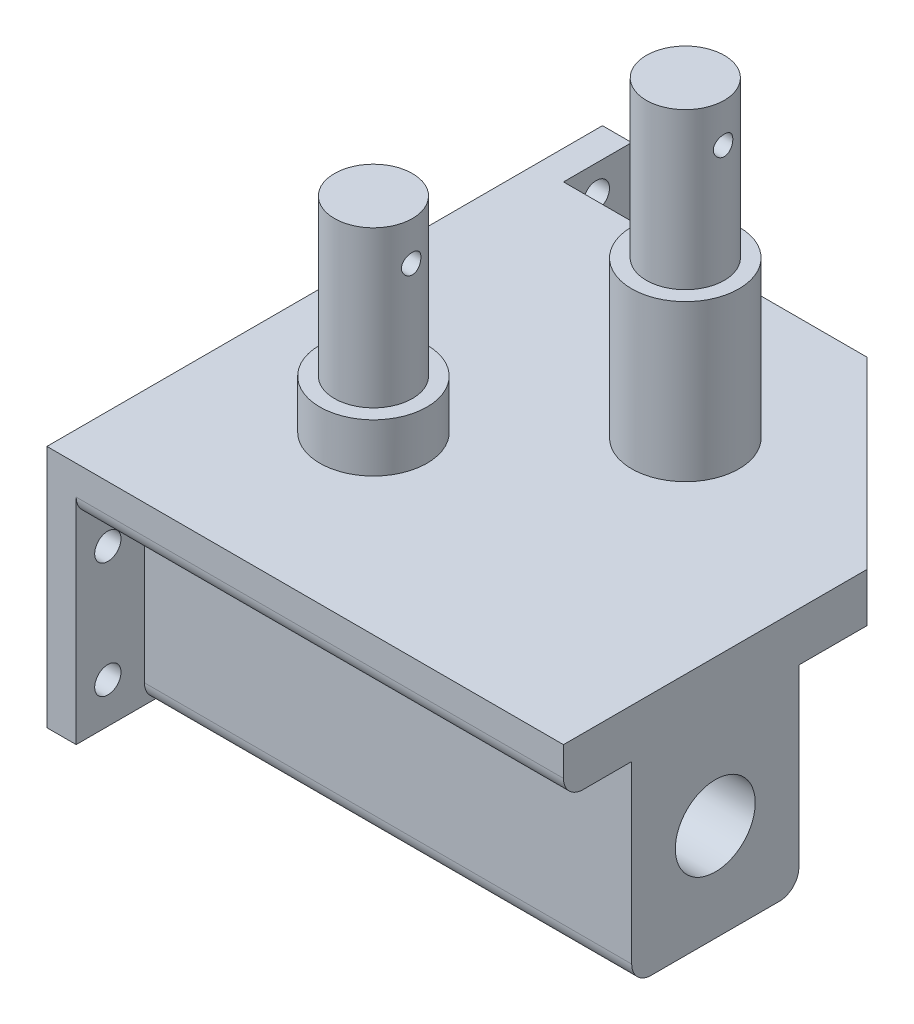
ISO-10303-21;
HEADER;
FILE_DESCRIPTION(('STEP AP214'),'2;1');
FILE_NAME('part.step','',(''),(''),'','','');
FILE_SCHEMA(('AUTOMOTIVE_DESIGN { 1 0 10303 214 1 1 1 1 }'));
ENDSEC;
DATA;
#1=APPLICATION_CONTEXT('core data for automotive mechanical design processes');
#2=APPLICATION_PROTOCOL_DEFINITION('international standard','automotive_design',2000,#1);
#3=PRODUCT_CONTEXT('',#1,'mechanical');
#4=PRODUCT('Part','Part','',(#3));
#5=PRODUCT_RELATED_PRODUCT_CATEGORY('part','',(#4));
#6=PRODUCT_DEFINITION_FORMATION('','',#4);
#7=PRODUCT_DEFINITION_CONTEXT('part definition',#1,'design');
#8=PRODUCT_DEFINITION('design','',#6,#7);
#9=PRODUCT_DEFINITION_SHAPE('','',#8);
#10=(LENGTH_UNIT() NAMED_UNIT(*) SI_UNIT(.MILLI.,.METRE.));
#11=(NAMED_UNIT(*) PLANE_ANGLE_UNIT() SI_UNIT($,.RADIAN.));
#12=(NAMED_UNIT(*) SI_UNIT($,.STERADIAN.) SOLID_ANGLE_UNIT());
#13=UNCERTAINTY_MEASURE_WITH_UNIT(LENGTH_MEASURE(1.E-05),#10,'distance_accuracy_value','');
#14=(GEOMETRIC_REPRESENTATION_CONTEXT(3) GLOBAL_UNCERTAINTY_ASSIGNED_CONTEXT((#13)) GLOBAL_UNIT_ASSIGNED_CONTEXT((#10,
#11,#12)) REPRESENTATION_CONTEXT('',''));
#15=CARTESIAN_POINT('',(0.,0.,0.));
#16=DIRECTION('',(0.,0.,1.));
#17=DIRECTION('',(1.,0.,0.));
#18=AXIS2_PLACEMENT_3D('',#15,#16,#17);
#19=CARTESIAN_POINT('',(0.,0.,0.));
#20=DIRECTION('',(0.,-1.,0.));
#21=DIRECTION('',(0.,0.,-1.));
#22=AXIS2_PLACEMENT_3D('',#19,#20,#21);
#23=PLANE('',#22);
#24=DIRECTION('',(0.,0.,1.));
#25=VECTOR('',#24,1.);
#26=CARTESIAN_POINT('',(-25.6189946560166,0.,25.6189946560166));
#27=LINE('',#26,#25);
#28=CARTESIAN_POINT('',(-25.6189946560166,0.,-22.3810053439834));
#29=VERTEX_POINT('',#28);
#30=CARTESIAN_POINT('',(-25.6189946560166,0.,1.46899465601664));
#31=VERTEX_POINT('',#30);
#32=EDGE_CURVE('E222',#29,#31,#27,.T.);
#33=ORIENTED_EDGE('',*,*,#32,.F.);
#34=DIRECTION('',(-1.,0.,0.));
#35=VECTOR('',#34,1.);
#36=CARTESIAN_POINT('',(5.53100534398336,0.,-22.3810053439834));
#37=LINE('',#36,#35);
#38=CARTESIAN_POINT('',(7.53100534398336,0.,-22.3810053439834));
#39=VERTEX_POINT('',#38);
#40=EDGE_CURVE('E257',#29,#39,#37,.F.);
#41=ORIENTED_EDGE('',*,*,#40,.T.);
#42=DIRECTION('',(-0.707106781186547,0.,-0.707106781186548));
#43=VECTOR('',#42,1.);
#44=CARTESIAN_POINT('',(5.53100534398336,0.,-24.3810053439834));
#45=LINE('',#44,#43);
#46=CARTESIAN_POINT('',(24.3810053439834,0.,-5.53100534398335));
#47=VERTEX_POINT('',#46);
#48=EDGE_CURVE('E215',#47,#39,#45,.T.);
#49=ORIENTED_EDGE('',*,*,#48,.F.);
#50=DIRECTION('',(0.,0.,-1.));
#51=VECTOR('',#50,1.);
#52=CARTESIAN_POINT('',(24.3810053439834,0.,6.76758151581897));
#53=LINE('',#52,#51);
#54=CARTESIAN_POINT('',(24.3810053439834,0.,1.46899465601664));
#55=VERTEX_POINT('',#54);
#56=EDGE_CURVE('E225',#55,#47,#53,.T.);
#57=ORIENTED_EDGE('',*,*,#56,.F.);
#58=DIRECTION('',(1.,0.,0.));
#59=VECTOR('',#58,1.);
#60=CARTESIAN_POINT('',(-25.6189946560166,0.,1.46899465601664));
#61=LINE('',#60,#59);
#62=EDGE_CURVE('E198',#31,#55,#61,.T.);
#63=ORIENTED_EDGE('',*,*,#62,.F.);
#64=EDGE_LOOP('',(#33,#41,#49,#57,#63));
#65=FACE_BOUND('',#64,.T.);
#66=ADVANCED_FACE('F33',(#65),#23,.T.);
#67=CARTESIAN_POINT('',(5.52959220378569,5.,25.6189946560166));
#68=DIRECTION('',(0.,0.,-1.));
#69=DIRECTION('',(-1.,0.,0.));
#70=AXIS2_PLACEMENT_3D('',#67,#68,#69);
#71=PLANE('',#70);
#72=DIRECTION('',(1.,0.,0.));
#73=VECTOR('',#72,1.);
#74=CARTESIAN_POINT('',(-25.6189946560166,5.,25.6189946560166));
#75=LINE('',#74,#73);
#76=CARTESIAN_POINT('',(-28.6189946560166,5.,25.6189946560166));
#77=VERTEX_POINT('',#76);
#78=CARTESIAN_POINT('',(24.3810053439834,5.,25.6189946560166));
#79=VERTEX_POINT('',#78);
#80=EDGE_CURVE('E212',#77,#79,#75,.T.);
#81=ORIENTED_EDGE('',*,*,#80,.F.);
#82=DIRECTION('',(0.,1.,0.));
#83=VECTOR('',#82,1.);
#84=CARTESIAN_POINT('',(-28.6189946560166,5.,25.6189946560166));
#85=LINE('',#84,#83);
#86=CARTESIAN_POINT('',(-28.6189946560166,-20.,25.6189946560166));
#87=VERTEX_POINT('',#86);
#88=EDGE_CURVE('E165',#87,#77,#85,.T.);
#89=ORIENTED_EDGE('',*,*,#88,.F.);
#90=DIRECTION('',(1.,0.,0.));
#91=VECTOR('',#90,1.);
#92=CARTESIAN_POINT('',(-28.6189946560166,-20.,25.6189946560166));
#93=LINE('',#92,#91);
#94=CARTESIAN_POINT('',(-25.6189946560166,-20.,25.6189946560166));
#95=VERTEX_POINT('',#94);
#96=EDGE_CURVE('E161',#87,#95,#93,.T.);
#97=ORIENTED_EDGE('',*,*,#96,.T.);
#98=DIRECTION('',(0.,1.,0.));
#99=VECTOR('',#98,1.);
#100=CARTESIAN_POINT('',(-25.6189946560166,5.,25.6189946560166));
#101=LINE('',#100,#99);
#102=CARTESIAN_POINT('',(-25.6189946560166,2.,25.6189946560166));
#103=VERTEX_POINT('',#102);
#104=EDGE_CURVE('E376',#95,#103,#101,.T.);
#105=ORIENTED_EDGE('',*,*,#104,.T.);
#106=DIRECTION('',(1.,0.,0.));
#107=VECTOR('',#106,1.);
#108=CARTESIAN_POINT('',(24.3810053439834,2.,25.6189946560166));
#109=LINE('',#108,#107);
#110=CARTESIAN_POINT('',(24.3810053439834,2.,25.6189946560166));
#111=VERTEX_POINT('',#110);
#112=EDGE_CURVE('E261',#103,#111,#109,.T.);
#113=ORIENTED_EDGE('',*,*,#112,.T.);
#114=DIRECTION('',(0.,-1.,0.));
#115=VECTOR('',#114,1.);
#116=CARTESIAN_POINT('',(24.3810053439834,5.,25.6189946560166));
#117=LINE('',#116,#115);
#118=EDGE_CURVE('E239',#79,#111,#117,.T.);
#119=ORIENTED_EDGE('',*,*,#118,.F.);
#120=EDGE_LOOP('',(#81,#89,#97,#105,#113,#119));
#121=FACE_BOUND('',#120,.T.);
#122=ADVANCED_FACE('F335',(#121),#71,.F.);
#123=CARTESIAN_POINT('',(24.3810053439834,5.,6.76758151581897));
#124=DIRECTION('',(-1.,0.,0.));
#125=DIRECTION('',(0.,0.,1.));
#126=AXIS2_PLACEMENT_3D('',#123,#124,#125);
#127=PLANE('',#126);
#128=CARTESIAN_POINT('',(24.3810053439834,-10.,10.0439946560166));
#129=DIRECTION('',(1.,0.,0.));
#130=DIRECTION('',(0.,0.,-1.));
#131=AXIS2_PLACEMENT_3D('',#128,#129,#130);
#132=CIRCLE('',#131,4.1);
#133=CARTESIAN_POINT('',(24.3810053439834,-10.,5.94399465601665));
#134=VERTEX_POINT('',#133);
#135=EDGE_CURVE('E183',#134,#134,#132,.T.);
#136=ORIENTED_EDGE('',*,*,#135,.F.);
#137=EDGE_LOOP('',(#136));
#138=FACE_BOUND('',#137,.T.);
#139=ORIENTED_EDGE('',*,*,#118,.T.);
#140=CARTESIAN_POINT('',(24.3810053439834,2.,23.6189946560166));
#141=DIRECTION('',(-1.,0.,0.));
#142=DIRECTION('',(0.,0.,1.));
#143=AXIS2_PLACEMENT_3D('',#140,#141,#142);
#144=CIRCLE('',#143,2.);
#145=CARTESIAN_POINT('',(24.3810053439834,0.,23.6189946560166));
#146=VERTEX_POINT('',#145);
#147=EDGE_CURVE('E266',#111,#146,#144,.F.);
#148=ORIENTED_EDGE('',*,*,#147,.T.);
#149=CARTESIAN_POINT('',(24.3810053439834,0.,18.6189946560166));
#150=VERTEX_POINT('',#149);
#151=EDGE_CURVE('E226',#146,#150,#53,.T.);
#152=ORIENTED_EDGE('',*,*,#151,.T.);
#153=DIRECTION('',(0.,1.,0.));
#154=VECTOR('',#153,1.);
#155=CARTESIAN_POINT('',(24.3810053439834,-20.,18.6189946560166));
#156=LINE('',#155,#154);
#157=CARTESIAN_POINT('',(24.3810053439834,-18.,18.6189946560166));
#158=VERTEX_POINT('',#157);
#159=EDGE_CURVE('E209',#158,#150,#156,.T.);
#160=ORIENTED_EDGE('',*,*,#159,.F.);
#161=CARTESIAN_POINT('',(24.3810053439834,-18.,16.6189946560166));
#162=DIRECTION('',(-1.,0.,0.));
#163=DIRECTION('',(0.,0.,1.));
#164=AXIS2_PLACEMENT_3D('',#161,#162,#163);
#165=CIRCLE('',#164,2.);
#166=CARTESIAN_POINT('',(24.3810053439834,-20.,16.6189946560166));
#167=VERTEX_POINT('',#166);
#168=EDGE_CURVE('E60',#158,#167,#165,.F.);
#169=ORIENTED_EDGE('',*,*,#168,.T.);
#170=DIRECTION('',(0.,0.,1.));
#171=VECTOR('',#170,1.);
#172=CARTESIAN_POINT('',(24.3810053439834,-20.,18.6189946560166));
#173=LINE('',#172,#171);
#174=CARTESIAN_POINT('',(24.3810053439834,-20.,3.46899465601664));
#175=VERTEX_POINT('',#174);
#176=EDGE_CURVE('E195',#175,#167,#173,.T.);
#177=ORIENTED_EDGE('',*,*,#176,.F.);
#178=CARTESIAN_POINT('',(24.3810053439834,-18.,3.46899465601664));
#179=DIRECTION('',(-1.,0.,0.));
#180=DIRECTION('',(0.,0.,1.));
#181=AXIS2_PLACEMENT_3D('',#178,#179,#180);
#182=CIRCLE('',#181,2.);
#183=CARTESIAN_POINT('',(24.3810053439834,-18.,1.46899465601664));
#184=VERTEX_POINT('',#183);
#185=EDGE_CURVE('E54',#175,#184,#182,.F.);
#186=ORIENTED_EDGE('',*,*,#185,.T.);
#187=DIRECTION('',(0.,1.,0.));
#188=VECTOR('',#187,1.);
#189=CARTESIAN_POINT('',(24.3810053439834,-20.,1.46899465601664));
#190=LINE('',#189,#188);
#191=EDGE_CURVE('E197',#184,#55,#190,.T.);
#192=ORIENTED_EDGE('',*,*,#191,.T.);
#193=ORIENTED_EDGE('',*,*,#56,.T.);
#194=DIRECTION('',(0.,-1.,0.));
#195=VECTOR('',#194,1.);
#196=CARTESIAN_POINT('',(24.3810053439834,5.,-5.53100534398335));
#197=LINE('',#196,#195);
#198=CARTESIAN_POINT('',(24.3810053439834,5.,-5.53100534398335));
#199=VERTEX_POINT('',#198);
#200=EDGE_CURVE('E236',#199,#47,#197,.T.);
#201=ORIENTED_EDGE('',*,*,#200,.F.);
#202=DIRECTION('',(0.,0.,-1.));
#203=VECTOR('',#202,1.);
#204=CARTESIAN_POINT('',(24.3810053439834,5.,25.6189946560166));
#205=LINE('',#204,#203);
#206=EDGE_CURVE('E214',#79,#199,#205,.T.);
#207=ORIENTED_EDGE('',*,*,#206,.F.);
#208=EDGE_LOOP('',(#139,#148,#152,#160,#169,#177,#186,#192,#193,#201,#207));
#209=FACE_BOUND('',#208,.T.);
#210=ADVANCED_FACE('F342',(#138,#209),#127,.F.);
#211=CARTESIAN_POINT('',(5.53100534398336,5.,-24.3810053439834));
#212=DIRECTION('',(-0.707106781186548,0.,0.707106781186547));
#213=DIRECTION('',(0.707106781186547,0.,0.707106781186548));
#214=AXIS2_PLACEMENT_3D('',#211,#212,#213);
#215=PLANE('',#214);
#216=ORIENTED_EDGE('',*,*,#48,.T.);
#217=CARTESIAN_POINT('',(7.53100534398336,2.,-22.3810053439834));
#218=DIRECTION('',(-0.707106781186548,0.,0.707106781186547));
#219=DIRECTION('',(0.707106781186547,0.,0.707106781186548));
#220=AXIS2_PLACEMENT_3D('',#217,#218,#219);
#221=ELLIPSE('',#220,2.82842712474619,2.);
#222=CARTESIAN_POINT('',(5.53100534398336,2.,-24.3810053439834));
#223=VERTEX_POINT('',#222);
#224=EDGE_CURVE('E259',#39,#223,#221,.F.);
#225=ORIENTED_EDGE('',*,*,#224,.T.);
#226=DIRECTION('',(0.,-1.,0.));
#227=VECTOR('',#226,1.);
#228=CARTESIAN_POINT('',(5.53100534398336,5.,-24.3810053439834));
#229=LINE('',#228,#227);
#230=CARTESIAN_POINT('',(5.53100534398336,5.,-24.3810053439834));
#231=VERTEX_POINT('',#230);
#232=EDGE_CURVE('E233',#231,#223,#229,.T.);
#233=ORIENTED_EDGE('',*,*,#232,.F.);
#234=DIRECTION('',(-0.707106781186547,0.,-0.707106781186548));
#235=VECTOR('',#234,1.);
#236=CARTESIAN_POINT('',(5.53100534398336,5.,-24.3810053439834));
#237=LINE('',#236,#235);
#238=EDGE_CURVE('E217',#199,#231,#237,.T.);
#239=ORIENTED_EDGE('',*,*,#238,.F.);
#240=ORIENTED_EDGE('',*,*,#200,.T.);
#241=EDGE_LOOP('',(#216,#225,#233,#239,#240));
#242=FACE_BOUND('',#241,.T.);
#243=ADVANCED_FACE('F475',(#242),#215,.F.);
#244=CARTESIAN_POINT('',(-25.6189946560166,5.,-24.3810053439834));
#245=DIRECTION('',(0.,0.,1.));
#246=DIRECTION('',(1.,0.,0.));
#247=AXIS2_PLACEMENT_3D('',#244,#245,#246);
#248=PLANE('',#247);
#249=ORIENTED_EDGE('',*,*,#232,.T.);
#250=DIRECTION('',(-1.,0.,0.));
#251=VECTOR('',#250,1.);
#252=CARTESIAN_POINT('',(-25.6189946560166,2.,-24.3810053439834));
#253=LINE('',#252,#251);
#254=CARTESIAN_POINT('',(-25.6189946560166,2.,-24.3810053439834));
#255=VERTEX_POINT('',#254);
#256=EDGE_CURVE('E242',#223,#255,#253,.T.);
#257=ORIENTED_EDGE('',*,*,#256,.T.);
#258=DIRECTION('',(0.,-1.,0.));
#259=VECTOR('',#258,1.);
#260=CARTESIAN_POINT('',(-25.6189946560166,5.,-24.3810053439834));
#261=LINE('',#260,#259);
#262=CARTESIAN_POINT('',(-25.6189946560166,5.,-24.3810053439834));
#263=VERTEX_POINT('',#262);
#264=EDGE_CURVE('E221',#263,#255,#261,.T.);
#265=ORIENTED_EDGE('',*,*,#264,.F.);
#266=DIRECTION('',(-1.,0.,0.));
#267=VECTOR('',#266,1.);
#268=CARTESIAN_POINT('',(-25.6189946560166,5.,-24.3810053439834));
#269=LINE('',#268,#267);
#270=EDGE_CURVE('E219',#231,#263,#269,.T.);
#271=ORIENTED_EDGE('',*,*,#270,.F.);
#272=EDGE_LOOP('',(#249,#257,#265,#271));
#273=FACE_BOUND('',#272,.T.);
#274=ADVANCED_FACE('F358',(#273),#248,.F.);
#275=CARTESIAN_POINT('',(0.,5.,0.));
#276=DIRECTION('',(0.,-1.,0.));
#277=DIRECTION('',(0.,0.,-1.));
#278=AXIS2_PLACEMENT_3D('',#275,#276,#277);
#279=PLANE('',#278);
#280=CARTESIAN_POINT('',(3.38100534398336,5.,-7.88100534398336));
#281=DIRECTION('',(0.,-1.,0.));
#282=DIRECTION('',(0.,0.,-1.));
#283=AXIS2_PLACEMENT_3D('',#280,#281,#282);
#284=CIRCLE('',#283,5.5);
#285=CARTESIAN_POINT('',(3.38100534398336,5.,-13.3810053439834));
#286=VERTEX_POINT('',#285);
#287=EDGE_CURVE('E11',#286,#286,#284,.F.);
#288=ORIENTED_EDGE('',*,*,#287,.F.);
#289=EDGE_LOOP('',(#288));
#290=FACE_BOUND('',#289,.T.);
#291=CARTESIAN_POINT('',(-13.1189946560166,5.,7.61899465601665));
#292=DIRECTION('',(0.,-1.,0.));
#293=DIRECTION('',(0.,0.,-1.));
#294=AXIS2_PLACEMENT_3D('',#291,#292,#293);
#295=CIRCLE('',#294,5.5);
#296=CARTESIAN_POINT('',(-13.1189946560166,5.,2.11899465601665));
#297=VERTEX_POINT('',#296);
#298=EDGE_CURVE('E46',#297,#297,#295,.F.);
#299=ORIENTED_EDGE('',*,*,#298,.F.);
#300=EDGE_LOOP('',(#299));
#301=FACE_BOUND('',#300,.T.);
#302=ORIENTED_EDGE('',*,*,#270,.T.);
#303=DIRECTION('',(0.,0.,-1.));
#304=VECTOR('',#303,1.);
#305=CARTESIAN_POINT('',(-25.6189946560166,4.99999999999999,-31.3810053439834));
#306=LINE('',#305,#304);
#307=CARTESIAN_POINT('',(-25.6189946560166,4.99999999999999,-31.3810053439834));
#308=VERTEX_POINT('',#307);
#309=EDGE_CURVE('E175',#263,#308,#306,.T.);
#310=ORIENTED_EDGE('',*,*,#309,.T.);
#311=DIRECTION('',(1.,0.,0.));
#312=VECTOR('',#311,1.);
#313=CARTESIAN_POINT('',(-28.6189946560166,4.99999999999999,-31.3810053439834));
#314=LINE('',#313,#312);
#315=CARTESIAN_POINT('',(-28.6189946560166,4.99999999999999,-31.3810053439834));
#316=VERTEX_POINT('',#315);
#317=EDGE_CURVE('E185',#316,#308,#314,.T.);
#318=ORIENTED_EDGE('',*,*,#317,.F.);
#319=DIRECTION('',(0.,0.,-1.));
#320=VECTOR('',#319,1.);
#321=CARTESIAN_POINT('',(-28.6189946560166,4.99999999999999,-31.3810053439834));
#322=LINE('',#321,#320);
#323=EDGE_CURVE('E171',#77,#316,#322,.T.);
#324=ORIENTED_EDGE('',*,*,#323,.F.);
#325=ORIENTED_EDGE('',*,*,#80,.T.);
#326=ORIENTED_EDGE('',*,*,#206,.T.);
#327=ORIENTED_EDGE('',*,*,#238,.T.);
#328=EDGE_LOOP('',(#302,#310,#318,#324,#325,#326,#327));
#329=FACE_BOUND('',#328,.T.);
#330=ADVANCED_FACE('F349',(#290,#301,#329),#279,.F.);
#331=ORIENTED_EDGE('',*,*,#151,.F.);
#332=DIRECTION('',(1.,0.,0.));
#333=VECTOR('',#332,1.);
#334=CARTESIAN_POINT('',(-25.6189946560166,0.,23.6189946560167));
#335=LINE('',#334,#333);
#336=CARTESIAN_POINT('',(-25.6189946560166,0.,23.6189946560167));
#337=VERTEX_POINT('',#336);
#338=EDGE_CURVE('E268',#146,#337,#335,.F.);
#339=ORIENTED_EDGE('',*,*,#338,.T.);
#340=CARTESIAN_POINT('',(-25.6189946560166,0.,18.6189946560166));
#341=VERTEX_POINT('',#340);
#342=EDGE_CURVE('E211',#341,#337,#27,.T.);
#343=ORIENTED_EDGE('',*,*,#342,.F.);
#344=DIRECTION('',(-1.,0.,0.));
#345=VECTOR('',#344,1.);
#346=CARTESIAN_POINT('',(-25.6189946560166,0.,18.6189946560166));
#347=LINE('',#346,#345);
#348=EDGE_CURVE('E192',#150,#341,#347,.T.);
#349=ORIENTED_EDGE('',*,*,#348,.F.);
#350=EDGE_LOOP('',(#331,#339,#343,#349));
#351=FACE_BOUND('',#350,.T.);
#352=ADVANCED_FACE('F338',(#351),#23,.T.);
#353=CARTESIAN_POINT('',(-25.6189946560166,-20.,18.6189946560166));
#354=DIRECTION('',(0.,0.,-1.));
#355=DIRECTION('',(-1.,0.,0.));
#356=AXIS2_PLACEMENT_3D('',#353,#354,#355);
#357=PLANE('',#356);
#358=DIRECTION('',(0.,1.,0.));
#359=VECTOR('',#358,1.);
#360=CARTESIAN_POINT('',(-25.6189946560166,-20.,18.6189946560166));
#361=LINE('',#360,#359);
#362=CARTESIAN_POINT('',(-25.6189946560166,-18.,18.6189946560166));
#363=VERTEX_POINT('',#362);
#364=EDGE_CURVE('E206',#363,#341,#361,.T.);
#365=ORIENTED_EDGE('',*,*,#364,.F.);
#366=DIRECTION('',(-1.,0.,0.));
#367=VECTOR('',#366,1.);
#368=CARTESIAN_POINT('',(24.3810053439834,-18.,18.6189946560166));
#369=LINE('',#368,#367);
#370=EDGE_CURVE('E277',#363,#158,#369,.F.);
#371=ORIENTED_EDGE('',*,*,#370,.T.);
#372=ORIENTED_EDGE('',*,*,#159,.T.);
#373=ORIENTED_EDGE('',*,*,#348,.T.);
#374=EDGE_LOOP('',(#365,#371,#372,#373));
#375=FACE_BOUND('',#374,.T.);
#376=ADVANCED_FACE('F348',(#375),#357,.F.);
#377=CARTESIAN_POINT('',(-25.6189946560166,-20.,1.46899465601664));
#378=DIRECTION('',(0.,0.,1.));
#379=DIRECTION('',(1.,0.,0.));
#380=AXIS2_PLACEMENT_3D('',#377,#378,#379);
#381=PLANE('',#380);
#382=ORIENTED_EDGE('',*,*,#191,.F.);
#383=DIRECTION('',(1.,0.,0.));
#384=VECTOR('',#383,1.);
#385=CARTESIAN_POINT('',(-25.6189946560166,-18.,1.46899465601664));
#386=LINE('',#385,#384);
#387=CARTESIAN_POINT('',(-25.6189946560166,-18.,1.46899465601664));
#388=VERTEX_POINT('',#387);
#389=EDGE_CURVE('E275',#184,#388,#386,.F.);
#390=ORIENTED_EDGE('',*,*,#389,.T.);
#391=DIRECTION('',(0.,1.,0.));
#392=VECTOR('',#391,1.);
#393=CARTESIAN_POINT('',(-25.6189946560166,-20.,1.46899465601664));
#394=LINE('',#393,#392);
#395=EDGE_CURVE('E204',#388,#31,#394,.T.);
#396=ORIENTED_EDGE('',*,*,#395,.T.);
#397=ORIENTED_EDGE('',*,*,#62,.T.);
#398=EDGE_LOOP('',(#382,#390,#396,#397));
#399=FACE_BOUND('',#398,.T.);
#400=ADVANCED_FACE('F355',(#399),#381,.F.);
#401=CARTESIAN_POINT('',(0.,-20.,0.));
#402=DIRECTION('',(0.,-1.,0.));
#403=DIRECTION('',(0.,0.,-1.));
#404=AXIS2_PLACEMENT_3D('',#401,#402,#403);
#405=PLANE('',#404);
#406=DIRECTION('',(-1.,0.,0.));
#407=VECTOR('',#406,1.);
#408=CARTESIAN_POINT('',(-25.6189946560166,-20.,16.6189946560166));
#409=LINE('',#408,#407);
#410=CARTESIAN_POINT('',(-25.6189946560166,-20.,16.6189946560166));
#411=VERTEX_POINT('',#410);
#412=EDGE_CURVE('E270',#167,#411,#409,.T.);
#413=ORIENTED_EDGE('',*,*,#412,.T.);
#414=DIRECTION('',(0.,0.,1.));
#415=VECTOR('',#414,1.);
#416=CARTESIAN_POINT('',(-25.6189946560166,-20.,-31.3810053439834));
#417=LINE('',#416,#415);
#418=EDGE_CURVE('E375',#411,#95,#417,.T.);
#419=ORIENTED_EDGE('',*,*,#418,.T.);
#420=ORIENTED_EDGE('',*,*,#96,.F.);
#421=DIRECTION('',(0.,0.,1.));
#422=VECTOR('',#421,1.);
#423=CARTESIAN_POINT('',(-28.6189946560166,-20.,-31.3810053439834));
#424=LINE('',#423,#422);
#425=CARTESIAN_POINT('',(-28.6189946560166,-20.,-31.3810053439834));
#426=VERTEX_POINT('',#425);
#427=EDGE_CURVE('E152',#426,#87,#424,.T.);
#428=ORIENTED_EDGE('',*,*,#427,.F.);
#429=DIRECTION('',(1.,0.,0.));
#430=VECTOR('',#429,1.);
#431=CARTESIAN_POINT('',(-28.6189946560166,-20.,-31.3810053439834));
#432=LINE('',#431,#430);
#433=CARTESIAN_POINT('',(-25.6189946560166,-20.,-31.3810053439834));
#434=VERTEX_POINT('',#433);
#435=EDGE_CURVE('E158',#426,#434,#432,.T.);
#436=ORIENTED_EDGE('',*,*,#435,.T.);
#437=CARTESIAN_POINT('',(-25.6189946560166,-20.,3.46899465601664));
#438=VERTEX_POINT('',#437);
#439=EDGE_CURVE('E377',#434,#438,#417,.T.);
#440=ORIENTED_EDGE('',*,*,#439,.T.);
#441=DIRECTION('',(1.,0.,0.));
#442=VECTOR('',#441,1.);
#443=CARTESIAN_POINT('',(24.3810053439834,-20.,3.46899465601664));
#444=LINE('',#443,#442);
#445=EDGE_CURVE('E272',#438,#175,#444,.T.);
#446=ORIENTED_EDGE('',*,*,#445,.T.);
#447=ORIENTED_EDGE('',*,*,#176,.T.);
#448=EDGE_LOOP('',(#413,#419,#420,#428,#436,#440,#446,#447));
#449=FACE_BOUND('',#448,.T.);
#450=ADVANCED_FACE('F155',(#449),#405,.T.);
#451=CARTESIAN_POINT('',(-5.61899465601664,-10.,10.0439946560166));
#452=DIRECTION('',(1.,0.,0.));
#453=DIRECTION('',(0.,0.,-1.));
#454=AXIS2_PLACEMENT_3D('',#451,#452,#453);
#455=CYLINDRICAL_SURFACE('',#454,4.1);
#456=CARTESIAN_POINT('',(-5.61899465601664,-10.,10.0439946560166));
#457=DIRECTION('',(1.,0.,0.));
#458=DIRECTION('',(0.,0.,-1.));
#459=AXIS2_PLACEMENT_3D('',#456,#457,#458);
#460=CIRCLE('',#459,4.1);
#461=CARTESIAN_POINT('',(-5.61899465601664,-10.,5.94399465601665));
#462=VERTEX_POINT('',#461);
#463=EDGE_CURVE('E189',#462,#462,#460,.T.);
#464=ORIENTED_EDGE('',*,*,#463,.F.);
#465=EDGE_LOOP('',(#464));
#466=FACE_BOUND('',#465,.T.);
#467=ORIENTED_EDGE('',*,*,#135,.T.);
#468=EDGE_LOOP('',(#467));
#469=FACE_BOUND('',#468,.T.);
#470=ADVANCED_FACE('F449',(#466,#469),#455,.F.);
#471=CARTESIAN_POINT('',(-5.61899465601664,-10.,10.0439946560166));
#472=DIRECTION('',(1.,0.,0.));
#473=DIRECTION('',(0.,0.,-1.));
#474=AXIS2_PLACEMENT_3D('',#471,#472,#473);
#475=PLANE('',#474);
#476=ORIENTED_EDGE('',*,*,#463,.T.);
#477=EDGE_LOOP('',(#476));
#478=FACE_BOUND('',#477,.T.);
#479=ADVANCED_FACE('F445',(#478),#475,.T.);
#480=CARTESIAN_POINT('',(-25.6189946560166,2.,-22.3810053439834));
#481=DIRECTION('',(1.,0.,0.));
#482=DIRECTION('',(0.,0.,-1.));
#483=AXIS2_PLACEMENT_3D('',#480,#481,#482);
#484=CYLINDRICAL_SURFACE('',#483,2.);
#485=ORIENTED_EDGE('',*,*,#224,.F.);
#486=ORIENTED_EDGE('',*,*,#40,.F.);
#487=CARTESIAN_POINT('',(-25.6189946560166,2.,-22.3810053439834));
#488=DIRECTION('',(1.,0.,0.));
#489=DIRECTION('',(0.,0.,-1.));
#490=AXIS2_PLACEMENT_3D('',#487,#488,#489);
#491=CIRCLE('',#490,2.);
#492=EDGE_CURVE('E254',#255,#29,#491,.F.);
#493=ORIENTED_EDGE('',*,*,#492,.F.);
#494=ORIENTED_EDGE('',*,*,#256,.F.);
#495=EDGE_LOOP('',(#485,#486,#493,#494));
#496=FACE_BOUND('',#495,.T.);
#497=ADVANCED_FACE('F448',(#496),#484,.T.);
#498=CARTESIAN_POINT('',(5.52959220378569,2.,23.6189946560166));
#499=DIRECTION('',(-1.,0.,0.));
#500=DIRECTION('',(0.,0.,1.));
#501=AXIS2_PLACEMENT_3D('',#498,#499,#500);
#502=CYLINDRICAL_SURFACE('',#501,2.);
#503=CARTESIAN_POINT('',(-25.6189946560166,2.,23.6189946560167));
#504=DIRECTION('',(1.,0.,0.));
#505=DIRECTION('',(0.,0.,-1.));
#506=AXIS2_PLACEMENT_3D('',#503,#504,#505);
#507=CIRCLE('',#506,2.);
#508=EDGE_CURVE('E251',#337,#103,#507,.F.);
#509=ORIENTED_EDGE('',*,*,#508,.F.);
#510=ORIENTED_EDGE('',*,*,#338,.F.);
#511=ORIENTED_EDGE('',*,*,#147,.F.);
#512=ORIENTED_EDGE('',*,*,#112,.F.);
#513=EDGE_LOOP('',(#509,#510,#511,#512));
#514=FACE_BOUND('',#513,.T.);
#515=ADVANCED_FACE('F365',(#514),#502,.T.);
#516=CARTESIAN_POINT('',(0.,-18.,3.46899465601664));
#517=DIRECTION('',(-1.,0.,0.));
#518=DIRECTION('',(0.,0.,1.));
#519=AXIS2_PLACEMENT_3D('',#516,#517,#518);
#520=CYLINDRICAL_SURFACE('',#519,2.);
#521=CARTESIAN_POINT('',(-25.6189946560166,-18.,3.46899465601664));
#522=DIRECTION('',(1.,0.,0.));
#523=DIRECTION('',(0.,0.,-1.));
#524=AXIS2_PLACEMENT_3D('',#521,#522,#523);
#525=CIRCLE('',#524,2.);
#526=EDGE_CURVE('E248',#388,#438,#525,.F.);
#527=ORIENTED_EDGE('',*,*,#526,.F.);
#528=ORIENTED_EDGE('',*,*,#389,.F.);
#529=ORIENTED_EDGE('',*,*,#185,.F.);
#530=ORIENTED_EDGE('',*,*,#445,.F.);
#531=EDGE_LOOP('',(#527,#528,#529,#530));
#532=FACE_BOUND('',#531,.T.);
#533=ADVANCED_FACE('F465',(#532),#520,.T.);
#534=CARTESIAN_POINT('',(0.,-18.,16.6189946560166));
#535=DIRECTION('',(1.,0.,0.));
#536=DIRECTION('',(0.,0.,-1.));
#537=AXIS2_PLACEMENT_3D('',#534,#535,#536);
#538=CYLINDRICAL_SURFACE('',#537,2.);
#539=ORIENTED_EDGE('',*,*,#168,.F.);
#540=ORIENTED_EDGE('',*,*,#370,.F.);
#541=CARTESIAN_POINT('',(-25.6189946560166,-18.,16.6189946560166));
#542=DIRECTION('',(1.,0.,0.));
#543=DIRECTION('',(0.,0.,-1.));
#544=AXIS2_PLACEMENT_3D('',#541,#542,#543);
#545=CIRCLE('',#544,2.);
#546=EDGE_CURVE('E245',#411,#363,#545,.F.);
#547=ORIENTED_EDGE('',*,*,#546,.F.);
#548=ORIENTED_EDGE('',*,*,#412,.F.);
#549=EDGE_LOOP('',(#539,#540,#547,#548));
#550=FACE_BOUND('',#549,.T.);
#551=ADVANCED_FACE('F35',(#550),#538,.T.);
#552=CARTESIAN_POINT('',(-13.1189946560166,10.,7.61899465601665));
#553=DIRECTION('',(0.,-1.,0.));
#554=DIRECTION('',(0.,0.,-1.));
#555=AXIS2_PLACEMENT_3D('',#552,#553,#554);
#556=CYLINDRICAL_SURFACE('',#555,5.5);
#557=CARTESIAN_POINT('',(-13.1189946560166,10.,7.61899465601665));
#558=DIRECTION('',(0.,1.,0.));
#559=DIRECTION('',(0.,0.,1.));
#560=AXIS2_PLACEMENT_3D('',#557,#558,#559);
#561=CIRCLE('',#560,5.5);
#562=CARTESIAN_POINT('',(-13.1189946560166,10.,13.1189946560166));
#563=VERTEX_POINT('',#562);
#564=EDGE_CURVE('E180',#563,#563,#561,.T.);
#565=ORIENTED_EDGE('',*,*,#564,.F.);
#566=EDGE_LOOP('',(#565));
#567=FACE_BOUND('',#566,.T.);
#568=ORIENTED_EDGE('',*,*,#298,.T.);
#569=EDGE_LOOP('',(#568));
#570=FACE_BOUND('',#569,.T.);
#571=ADVANCED_FACE('F437',(#567,#570),#556,.T.);
#572=CARTESIAN_POINT('',(-13.1189946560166,10.,7.61899465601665));
#573=DIRECTION('',(0.,1.,0.));
#574=DIRECTION('',(0.,0.,1.));
#575=AXIS2_PLACEMENT_3D('',#572,#573,#574);
#576=PLANE('',#575);
#577=CARTESIAN_POINT('',(-13.1189946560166,10.,7.61899465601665));
#578=DIRECTION('',(0.,1.,0.));
#579=DIRECTION('',(0.,0.,1.));
#580=AXIS2_PLACEMENT_3D('',#577,#578,#579);
#581=CIRCLE('',#580,4.);
#582=CARTESIAN_POINT('',(-13.1189946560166,10.,11.6189946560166));
#583=VERTEX_POINT('',#582);
#584=EDGE_CURVE('E402',#583,#583,#581,.T.);
#585=ORIENTED_EDGE('',*,*,#584,.F.);
#586=EDGE_LOOP('',(#585));
#587=FACE_BOUND('',#586,.T.);
#588=ORIENTED_EDGE('',*,*,#564,.T.);
#589=EDGE_LOOP('',(#588));
#590=FACE_BOUND('',#589,.T.);
#591=ADVANCED_FACE('F428',(#587,#590),#576,.T.);
#592=CARTESIAN_POINT('',(3.38100534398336,10.,-7.88100534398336));
#593=DIRECTION('',(0.,-1.,0.));
#594=DIRECTION('',(0.,0.,-1.));
#595=AXIS2_PLACEMENT_3D('',#592,#593,#594);
#596=CYLINDRICAL_SURFACE('',#595,5.5);
#597=ORIENTED_EDGE('',*,*,#287,.T.);
#598=EDGE_LOOP('',(#597));
#599=FACE_BOUND('',#598,.T.);
#600=CARTESIAN_POINT('',(3.38100534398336,21.,-7.88100534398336));
#601=DIRECTION('',(0.,1.,0.));
#602=DIRECTION('',(0.,0.,1.));
#603=AXIS2_PLACEMENT_3D('',#600,#601,#602);
#604=CIRCLE('',#603,5.5);
#605=CARTESIAN_POINT('',(3.38100534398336,21.,-2.38100534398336));
#606=VERTEX_POINT('',#605);
#607=EDGE_CURVE('E405',#606,#606,#604,.T.);
#608=ORIENTED_EDGE('',*,*,#607,.F.);
#609=EDGE_LOOP('',(#608));
#610=FACE_BOUND('',#609,.T.);
#611=ADVANCED_FACE('F425',(#599,#610),#596,.T.);
#612=CARTESIAN_POINT('',(-25.6189946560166,0.,0.));
#613=DIRECTION('',(-1.,0.,0.));
#614=DIRECTION('',(0.,0.,1.));
#615=AXIS2_PLACEMENT_3D('',#612,#613,#614);
#616=PLANE('',#615);
#617=CARTESIAN_POINT('',(-25.6189946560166,-15.858034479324,-27.7526615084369));
#618=DIRECTION('',(-1.,0.,0.));
#619=DIRECTION('',(0.,0.,1.));
#620=AXIS2_PLACEMENT_3D('',#617,#618,#619);
#621=CIRCLE('',#620,1.35);
#622=CARTESIAN_POINT('',(-25.6189946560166,-15.858034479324,-26.4026615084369));
#623=VERTEX_POINT('',#622);
#624=EDGE_CURVE('E288',#623,#623,#621,.T.);
#625=ORIENTED_EDGE('',*,*,#624,.T.);
#626=EDGE_LOOP('',(#625));
#627=FACE_BOUND('',#626,.T.);
#628=CARTESIAN_POINT('',(-25.6189946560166,2.09174198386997,-27.7526615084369));
#629=DIRECTION('',(-1.,0.,0.));
#630=DIRECTION('',(0.,0.,1.));
#631=AXIS2_PLACEMENT_3D('',#628,#629,#630);
#632=CIRCLE('',#631,1.35);
#633=CARTESIAN_POINT('',(-25.6189946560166,2.09174198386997,-26.4026615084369));
#634=VERTEX_POINT('',#633);
#635=EDGE_CURVE('E379',#634,#634,#632,.T.);
#636=ORIENTED_EDGE('',*,*,#635,.T.);
#637=EDGE_LOOP('',(#636));
#638=FACE_BOUND('',#637,.T.);
#639=ORIENTED_EDGE('',*,*,#309,.F.);
#640=ORIENTED_EDGE('',*,*,#264,.T.);
#641=ORIENTED_EDGE('',*,*,#492,.T.);
#642=ORIENTED_EDGE('',*,*,#32,.T.);
#643=ORIENTED_EDGE('',*,*,#395,.F.);
#644=ORIENTED_EDGE('',*,*,#526,.T.);
#645=ORIENTED_EDGE('',*,*,#439,.F.);
#646=DIRECTION('',(0.,-1.,0.));
#647=VECTOR('',#646,1.);
#648=CARTESIAN_POINT('',(-25.6189946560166,4.99999999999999,-31.3810053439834));
#649=LINE('',#648,#647);
#650=EDGE_CURVE('E179',#308,#434,#649,.T.);
#651=ORIENTED_EDGE('',*,*,#650,.F.);
#652=EDGE_LOOP('',(#639,#640,#641,#642,#643,#644,#645,#651));
#653=FACE_BOUND('',#652,.T.);
#654=ADVANCED_FACE('F427',(#627,#638,#653),#616,.F.);
#655=CARTESIAN_POINT('',(-28.6189946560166,4.99999999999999,-31.3810053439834));
#656=DIRECTION('',(0.,0.,1.));
#657=DIRECTION('',(1.,0.,0.));
#658=AXIS2_PLACEMENT_3D('',#655,#656,#657);
#659=PLANE('',#658);
#660=ORIENTED_EDGE('',*,*,#650,.T.);
#661=ORIENTED_EDGE('',*,*,#435,.F.);
#662=DIRECTION('',(0.,-1.,0.));
#663=VECTOR('',#662,1.);
#664=CARTESIAN_POINT('',(-28.6189946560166,4.99999999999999,-31.3810053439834));
#665=LINE('',#664,#663);
#666=EDGE_CURVE('E166',#316,#426,#665,.T.);
#667=ORIENTED_EDGE('',*,*,#666,.F.);
#668=ORIENTED_EDGE('',*,*,#317,.T.);
#669=EDGE_LOOP('',(#660,#661,#667,#668));
#670=FACE_BOUND('',#669,.T.);
#671=ADVANCED_FACE('F177',(#670),#659,.F.);
#672=CARTESIAN_POINT('',(-28.6189946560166,0.,0.));
#673=DIRECTION('',(-1.,0.,0.));
#674=DIRECTION('',(0.,0.,1.));
#675=AXIS2_PLACEMENT_3D('',#672,#673,#674);
#676=PLANE('',#675);
#677=CARTESIAN_POINT('',(-28.6189946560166,-15.858034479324,-27.7526615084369));
#678=DIRECTION('',(1.,0.,0.));
#679=DIRECTION('',(0.,0.,-1.));
#680=AXIS2_PLACEMENT_3D('',#677,#678,#679);
#681=CIRCLE('',#680,1.35);
#682=CARTESIAN_POINT('',(-28.6189946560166,-15.858034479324,-29.1026615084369));
#683=VERTEX_POINT('',#682);
#684=EDGE_CURVE('E285',#683,#683,#681,.T.);
#685=ORIENTED_EDGE('',*,*,#684,.T.);
#686=EDGE_LOOP('',(#685));
#687=FACE_BOUND('',#686,.T.);
#688=CARTESIAN_POINT('',(-28.6189946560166,-15.858034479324,22.3681999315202));
#689=DIRECTION('',(1.,0.,0.));
#690=DIRECTION('',(0.,0.,-1.));
#691=AXIS2_PLACEMENT_3D('',#688,#689,#690);
#692=CIRCLE('',#691,1.35);
#693=CARTESIAN_POINT('',(-28.6189946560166,-15.858034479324,21.0181999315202));
#694=VERTEX_POINT('',#693);
#695=EDGE_CURVE('E396',#694,#694,#692,.T.);
#696=ORIENTED_EDGE('',*,*,#695,.T.);
#697=EDGE_LOOP('',(#696));
#698=FACE_BOUND('',#697,.T.);
#699=CARTESIAN_POINT('',(-28.6189946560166,-3.99604314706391,22.3681999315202));
#700=DIRECTION('',(1.,0.,0.));
#701=DIRECTION('',(0.,0.,-1.));
#702=AXIS2_PLACEMENT_3D('',#699,#700,#701);
#703=CIRCLE('',#702,1.35);
#704=CARTESIAN_POINT('',(-28.6189946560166,-3.99604314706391,21.0181999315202));
#705=VERTEX_POINT('',#704);
#706=EDGE_CURVE('E393',#705,#705,#703,.T.);
#707=ORIENTED_EDGE('',*,*,#706,.T.);
#708=EDGE_LOOP('',(#707));
#709=FACE_BOUND('',#708,.T.);
#710=CARTESIAN_POINT('',(-28.6189946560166,2.09174198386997,-27.7526615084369));
#711=DIRECTION('',(1.,0.,0.));
#712=DIRECTION('',(0.,0.,-1.));
#713=AXIS2_PLACEMENT_3D('',#710,#711,#712);
#714=CIRCLE('',#713,1.35);
#715=CARTESIAN_POINT('',(-28.6189946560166,2.09174198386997,-29.1026615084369));
#716=VERTEX_POINT('',#715);
#717=EDGE_CURVE('E388',#716,#716,#714,.T.);
#718=ORIENTED_EDGE('',*,*,#717,.T.);
#719=EDGE_LOOP('',(#718));
#720=FACE_BOUND('',#719,.T.);
#721=ORIENTED_EDGE('',*,*,#666,.T.);
#722=ORIENTED_EDGE('',*,*,#427,.T.);
#723=ORIENTED_EDGE('',*,*,#88,.T.);
#724=ORIENTED_EDGE('',*,*,#323,.T.);
#725=EDGE_LOOP('',(#721,#722,#723,#724));
#726=FACE_BOUND('',#725,.T.);
#727=ADVANCED_FACE('F169',(#687,#698,#709,#720,#726),#676,.T.);
#728=CARTESIAN_POINT('',(-25.6189946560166,-15.858034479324,22.3681999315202));
#729=DIRECTION('',(-1.,0.,0.));
#730=DIRECTION('',(0.,0.,1.));
#731=AXIS2_PLACEMENT_3D('',#728,#729,#730);
#732=CIRCLE('',#731,1.35);
#733=CARTESIAN_POINT('',(-25.6189946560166,-15.858034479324,23.7181999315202));
#734=VERTEX_POINT('',#733);
#735=EDGE_CURVE('E284',#734,#734,#732,.T.);
#736=ORIENTED_EDGE('',*,*,#735,.T.);
#737=EDGE_LOOP('',(#736));
#738=FACE_BOUND('',#737,.T.);
#739=CARTESIAN_POINT('',(-25.6189946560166,-3.99604314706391,22.3681999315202));
#740=DIRECTION('',(-1.,0.,0.));
#741=DIRECTION('',(0.,0.,1.));
#742=AXIS2_PLACEMENT_3D('',#739,#740,#741);
#743=CIRCLE('',#742,1.35);
#744=CARTESIAN_POINT('',(-25.6189946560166,-3.99604314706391,23.7181999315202));
#745=VERTEX_POINT('',#744);
#746=EDGE_CURVE('E281',#745,#745,#743,.T.);
#747=ORIENTED_EDGE('',*,*,#746,.T.);
#748=EDGE_LOOP('',(#747));
#749=FACE_BOUND('',#748,.T.);
#750=ORIENTED_EDGE('',*,*,#418,.F.);
#751=ORIENTED_EDGE('',*,*,#546,.T.);
#752=ORIENTED_EDGE('',*,*,#364,.T.);
#753=ORIENTED_EDGE('',*,*,#342,.T.);
#754=ORIENTED_EDGE('',*,*,#508,.T.);
#755=ORIENTED_EDGE('',*,*,#104,.F.);
#756=EDGE_LOOP('',(#750,#751,#752,#753,#754,#755));
#757=FACE_BOUND('',#756,.T.);
#758=ADVANCED_FACE('F371',(#738,#749,#757),#616,.F.);
#759=CARTESIAN_POINT('',(-28.6189946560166,2.09174198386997,-27.7526615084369));
#760=DIRECTION('',(1.,0.,0.));
#761=DIRECTION('',(0.,0.,-1.));
#762=AXIS2_PLACEMENT_3D('',#759,#760,#761);
#763=CYLINDRICAL_SURFACE('',#762,1.35);
#764=ORIENTED_EDGE('',*,*,#717,.F.);
#765=EDGE_LOOP('',(#764));
#766=FACE_BOUND('',#765,.T.);
#767=ORIENTED_EDGE('',*,*,#635,.F.);
#768=EDGE_LOOP('',(#767));
#769=FACE_BOUND('',#768,.T.);
#770=ADVANCED_FACE('F581',(#766,#769),#763,.F.);
#771=CARTESIAN_POINT('',(-28.6189946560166,-3.99604314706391,22.3681999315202));
#772=DIRECTION('',(1.,0.,0.));
#773=DIRECTION('',(0.,0.,-1.));
#774=AXIS2_PLACEMENT_3D('',#771,#772,#773);
#775=CYLINDRICAL_SURFACE('',#774,1.35);
#776=ORIENTED_EDGE('',*,*,#706,.F.);
#777=EDGE_LOOP('',(#776));
#778=FACE_BOUND('',#777,.T.);
#779=ORIENTED_EDGE('',*,*,#746,.F.);
#780=EDGE_LOOP('',(#779));
#781=FACE_BOUND('',#780,.T.);
#782=ADVANCED_FACE('F573',(#778,#781),#775,.F.);
#783=CARTESIAN_POINT('',(-28.6189946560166,-15.858034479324,22.3681999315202));
#784=DIRECTION('',(1.,0.,0.));
#785=DIRECTION('',(0.,0.,-1.));
#786=AXIS2_PLACEMENT_3D('',#783,#784,#785);
#787=CYLINDRICAL_SURFACE('',#786,1.35);
#788=ORIENTED_EDGE('',*,*,#695,.F.);
#789=EDGE_LOOP('',(#788));
#790=FACE_BOUND('',#789,.T.);
#791=ORIENTED_EDGE('',*,*,#735,.F.);
#792=EDGE_LOOP('',(#791));
#793=FACE_BOUND('',#792,.T.);
#794=ADVANCED_FACE('F569',(#790,#793),#787,.F.);
#795=CARTESIAN_POINT('',(-28.6189946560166,-15.858034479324,-27.7526615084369));
#796=DIRECTION('',(1.,0.,0.));
#797=DIRECTION('',(0.,0.,-1.));
#798=AXIS2_PLACEMENT_3D('',#795,#796,#797);
#799=CYLINDRICAL_SURFACE('',#798,1.35);
#800=ORIENTED_EDGE('',*,*,#684,.F.);
#801=EDGE_LOOP('',(#800));
#802=FACE_BOUND('',#801,.T.);
#803=ORIENTED_EDGE('',*,*,#624,.F.);
#804=EDGE_LOOP('',(#803));
#805=FACE_BOUND('',#804,.T.);
#806=ADVANCED_FACE('F515',(#802,#805),#799,.F.);
#807=CARTESIAN_POINT('',(-13.1189946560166,26.,7.61899465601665));
#808=DIRECTION('',(0.,-1.,0.));
#809=DIRECTION('',(0.,0.,-1.));
#810=AXIS2_PLACEMENT_3D('',#807,#808,#809);
#811=CYLINDRICAL_SURFACE('',#810,4.);
#812=CARTESIAN_POINT('',(-9.24601130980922,22.,8.61899465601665));
#813=CARTESIAN_POINT('',(-9.24601025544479,22.0552203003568,8.61899308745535));
#814=CARTESIAN_POINT('',(-9.24481743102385,22.1104579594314,8.61440515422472));
#815=CARTESIAN_POINT('',(-9.24018720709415,22.2193470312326,8.59620390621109));
#816=CARTESIAN_POINT('',(-9.23674850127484,22.27299750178,8.58258533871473));
#817=CARTESIAN_POINT('',(-9.22803975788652,22.3771214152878,8.54679113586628));
#818=CARTESIAN_POINT('',(-9.22277208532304,22.4275988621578,8.52462654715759));
#819=CARTESIAN_POINT('',(-9.21100188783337,22.5241243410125,8.47240311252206));
#820=CARTESIAN_POINT('',(-9.20449931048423,22.5701721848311,8.44234393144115));
#821=CARTESIAN_POINT('',(-9.19083179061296,22.6575446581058,8.37447802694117));
#822=CARTESIAN_POINT('',(-9.18365626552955,22.6987574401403,8.33652941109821));
#823=CARTESIAN_POINT('',(-9.16954315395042,22.7743045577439,8.25426748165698));
#824=CARTESIAN_POINT('',(-9.16260558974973,22.8086382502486,8.20995357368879));
#825=CARTESIAN_POINT('',(-9.14963299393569,22.8699101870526,8.11545273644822));
#826=CARTESIAN_POINT('',(-9.14361190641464,22.8967385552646,8.06519248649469));
#827=CARTESIAN_POINT('',(-9.13327140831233,22.9415238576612,7.96069992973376));
#828=CARTESIAN_POINT('',(-9.12895174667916,22.9594821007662,7.90646821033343));
#829=CARTESIAN_POINT('',(-9.12257562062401,22.9856591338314,7.79673815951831));
#830=CARTESIAN_POINT('',(-9.12047508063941,22.9940678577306,7.74128774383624));
#831=CARTESIAN_POINT('',(-9.11862027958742,23.0015033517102,7.62972618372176));
#832=CARTESIAN_POINT('',(-9.11886567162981,23.0005315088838,7.57361513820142));
#833=CARTESIAN_POINT('',(-9.12164227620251,22.9893700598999,7.46364240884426));
#834=CARTESIAN_POINT('',(-9.12412264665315,22.9793854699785,7.40975844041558));
#835=CARTESIAN_POINT('',(-9.13103130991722,22.9508114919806,7.30445640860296));
#836=CARTESIAN_POINT('',(-9.13545970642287,22.932221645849,7.25303847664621));
#837=CARTESIAN_POINT('',(-9.14584461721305,22.8867989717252,7.15358795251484));
#838=CARTESIAN_POINT('',(-9.15181457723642,22.8598931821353,7.10559014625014));
#839=CARTESIAN_POINT('',(-9.16463504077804,22.7986577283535,7.01471903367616));
#840=CARTESIAN_POINT('',(-9.17148569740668,22.7643267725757,6.97184662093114));
#841=CARTESIAN_POINT('',(-9.18553980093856,22.688116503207,6.89122062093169));
#842=CARTESIAN_POINT('',(-9.19274777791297,22.6460580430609,6.85363697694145));
#843=CARTESIAN_POINT('',(-9.20653448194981,22.5561600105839,6.78601828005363));
#844=CARTESIAN_POINT('',(-9.21311317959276,22.5083201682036,6.75598357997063));
#845=CARTESIAN_POINT('',(-9.22491266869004,22.4078839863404,6.70420652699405));
#846=CARTESIAN_POINT('',(-9.23012672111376,22.3552657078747,6.68250508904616));
#847=CARTESIAN_POINT('',(-9.23852009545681,22.2469658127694,6.64830903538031));
#848=CARTESIAN_POINT('',(-9.24169985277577,22.1912848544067,6.63581244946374));
#849=CARTESIAN_POINT('',(-9.24557323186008,22.0800161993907,6.62066280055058));
#850=CARTESIAN_POINT('',(-9.24633029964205,22.0244648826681,6.6177584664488));
#851=CARTESIAN_POINT('',(-9.24544528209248,21.9136712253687,6.62118785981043));
#852=CARTESIAN_POINT('',(-9.24380341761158,21.8584288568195,6.62752073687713));
#853=CARTESIAN_POINT('',(-9.2383663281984,21.7507542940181,6.64902447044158));
#854=CARTESIAN_POINT('',(-9.23460677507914,21.6982909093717,6.66404902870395));
#855=CARTESIAN_POINT('',(-9.22539178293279,21.5966274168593,6.7023474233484));
#856=CARTESIAN_POINT('',(-9.21993614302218,21.5474276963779,6.72562223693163));
#857=CARTESIAN_POINT('',(-9.20781010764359,21.4526234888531,6.78028638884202));
#858=CARTESIAN_POINT('',(-9.20111798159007,21.4071084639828,6.81182595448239));
#859=CARTESIAN_POINT('',(-9.18732632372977,21.3219246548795,6.88193436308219));
#860=CARTESIAN_POINT('',(-9.18022672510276,21.28225683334,6.92050436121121));
#861=CARTESIAN_POINT('',(-9.16620504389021,21.2088755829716,7.00473193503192));
#862=CARTESIAN_POINT('',(-9.1592918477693,21.1753359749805,7.05054270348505));
#863=CARTESIAN_POINT('',(-9.1466057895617,21.1164256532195,7.14729197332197));
#864=CARTESIAN_POINT('',(-9.1408328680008,21.0910545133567,7.19823020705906));
#865=CARTESIAN_POINT('',(-9.13111419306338,21.0494215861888,7.30343645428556));
#866=CARTESIAN_POINT('',(-9.127155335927,21.0330942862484,7.35767727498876));
#867=CARTESIAN_POINT('',(-9.12145348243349,21.0098158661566,7.46824489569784));
#868=CARTESIAN_POINT('',(-9.119710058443,21.0028629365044,7.5245712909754));
#869=CARTESIAN_POINT('',(-9.11865296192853,20.9986324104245,7.63607818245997));
#870=CARTESIAN_POINT('',(-9.11927486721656,21.0010982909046,7.69124848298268));
#871=CARTESIAN_POINT('',(-9.1227356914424,21.0150478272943,7.80036215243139));
#872=CARTESIAN_POINT('',(-9.12557454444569,21.0265312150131,7.85430555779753));
#873=CARTESIAN_POINT('',(-9.133140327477,21.0580522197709,7.95916569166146));
#874=CARTESIAN_POINT('',(-9.13785701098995,21.0780434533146,8.01009715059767));
#875=CARTESIAN_POINT('',(-9.14868176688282,21.1259705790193,8.10791170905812));
#876=CARTESIAN_POINT('',(-9.15479001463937,21.1539074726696,8.1547942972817));
#877=CARTESIAN_POINT('',(-9.16792215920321,21.2177152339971,8.24439658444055));
#878=CARTESIAN_POINT('',(-9.17496448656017,21.2537601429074,8.28698964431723));
#879=CARTESIAN_POINT('',(-9.18908816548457,21.3324228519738,8.3656096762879));
#880=CARTESIAN_POINT('',(-9.1961695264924,21.3750423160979,8.40163498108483));
#881=CARTESIAN_POINT('',(-9.20971989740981,21.4666014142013,8.46675668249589));
#882=CARTESIAN_POINT('',(-9.21617501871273,21.5156441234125,8.49571127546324));
#883=CARTESIAN_POINT('',(-9.22755510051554,21.6180554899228,8.54492155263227));
#884=CARTESIAN_POINT('',(-9.23248117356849,21.6714209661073,8.56518356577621));
#885=CARTESIAN_POINT('',(-9.23947556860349,21.7705770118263,8.59341718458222));
#886=CARTESIAN_POINT('',(-9.24190802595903,21.8158931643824,8.60298782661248));
#887=CARTESIAN_POINT('',(-9.24517627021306,21.9074688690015,8.61577694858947));
#888=CARTESIAN_POINT('',(-9.24601219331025,21.9537283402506,8.61899597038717));
#889=CARTESIAN_POINT('',(-9.24601130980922,22.,8.61899465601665));
#890=B_SPLINE_CURVE_WITH_KNOTS('',3,(#812,#813,#814,#815,#816,#817,#818,#819,#820,#821,#822,
#823,#824,#825,#826,#827,#828,#829,#830,#831,#832,#833,#834,#835,#836,#837,#838,#839,#840,#841,
#842,#843,#844,#845,#846,#847,#848,#849,#850,#851,#852,#853,#854,#855,#856,#857,#858,#859,#860,
#861,#862,#863,#864,#865,#866,#867,#868,#869,#870,#871,#872,#873,#874,#875,#876,#877,#878,#879,
#880,#881,#882,#883,#884,#885,#886,#887,#888,#889),.UNSPECIFIED.,.T.,.F.,(4,2,2,2,2,2,2,2,2,2,2,
2,2,2,2,2,2,2,2,2,2,2,2,2,2,2,2,2,2,2,2,2,2,2,2,2,2,2,4),(0.,0.16549097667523,0.331078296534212,
0.496452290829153,0.66183330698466,0.830495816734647,0.999174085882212,1.17020598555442,
1.34121263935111,1.50875500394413,1.67627259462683,1.84007305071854,2.00388222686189,
2.16917149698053,2.3344895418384,2.5042818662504,2.67408212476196,2.84470572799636,
3.01529280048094,3.18137429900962,3.34744050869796,3.51078961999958,3.67415808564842,
3.84073138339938,4.00733207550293,4.17810132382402,4.34886166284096,4.51836829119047,
4.6878421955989,4.85273378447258,5.01762046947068,5.18161950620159,5.34563922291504,
5.51358838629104,5.68158012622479,5.85270590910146,6.02370688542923,6.16239130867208,
6.30106390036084),.UNSPECIFIED.);
#891=CARTESIAN_POINT('',(-9.24601130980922,22.,8.61899465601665));
#892=VERTEX_POINT('',#891);
#893=EDGE_CURVE('E296',#892,#892,#890,.T.);
#894=ORIENTED_EDGE('',*,*,#893,.T.);
#895=EDGE_LOOP('',(#894));
#896=FACE_BOUND('',#895,.T.);
#897=CARTESIAN_POINT('',(-16.9919780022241,22.,8.61899465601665));
#898=CARTESIAN_POINT('',(-16.9919790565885,21.9447796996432,8.61899308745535));
#899=CARTESIAN_POINT('',(-16.9931718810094,21.8895420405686,8.61440515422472));
#900=CARTESIAN_POINT('',(-16.9978021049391,21.7806529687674,8.59620390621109));
#901=CARTESIAN_POINT('',(-17.0012408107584,21.72700249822,8.58258533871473));
#902=CARTESIAN_POINT('',(-17.0099495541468,21.6228785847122,8.54679113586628));
#903=CARTESIAN_POINT('',(-17.0152172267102,21.5724011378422,8.52462654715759));
#904=CARTESIAN_POINT('',(-17.0269874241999,21.4758756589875,8.47240311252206));
#905=CARTESIAN_POINT('',(-17.033490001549,21.4298278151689,8.44234393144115));
#906=CARTESIAN_POINT('',(-17.0471575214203,21.3424553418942,8.37447802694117));
#907=CARTESIAN_POINT('',(-17.0543330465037,21.3012425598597,8.33652941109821));
#908=CARTESIAN_POINT('',(-17.0684461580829,21.2256954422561,8.25426748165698));
#909=CARTESIAN_POINT('',(-17.0753837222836,21.1913617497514,8.20995357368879));
#910=CARTESIAN_POINT('',(-17.0883563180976,21.1300898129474,8.11545273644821));
#911=CARTESIAN_POINT('',(-17.0943774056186,21.1032614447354,8.06519248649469));
#912=CARTESIAN_POINT('',(-17.1047179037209,21.0584761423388,7.96069992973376));
#913=CARTESIAN_POINT('',(-17.1090375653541,21.0405178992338,7.90646821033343));
#914=CARTESIAN_POINT('',(-17.1154136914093,21.0143408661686,7.79673815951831));
#915=CARTESIAN_POINT('',(-17.1175142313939,21.0059321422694,7.74128774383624));
#916=CARTESIAN_POINT('',(-17.1193690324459,20.9984966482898,7.62972618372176));
#917=CARTESIAN_POINT('',(-17.1191236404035,20.9994684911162,7.57361513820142));
#918=CARTESIAN_POINT('',(-17.1163470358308,21.0106299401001,7.46364240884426));
#919=CARTESIAN_POINT('',(-17.1138666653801,21.0206145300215,7.40975844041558));
#920=CARTESIAN_POINT('',(-17.1069580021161,21.0491885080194,7.30445640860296));
#921=CARTESIAN_POINT('',(-17.1025296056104,21.067778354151,7.25303847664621));
#922=CARTESIAN_POINT('',(-17.0921446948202,21.1132010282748,7.15358795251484));
#923=CARTESIAN_POINT('',(-17.0861747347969,21.1401068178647,7.10559014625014));
#924=CARTESIAN_POINT('',(-17.0733542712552,21.2013422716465,7.01471903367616));
#925=CARTESIAN_POINT('',(-17.0665036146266,21.2356732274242,6.97184662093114));
#926=CARTESIAN_POINT('',(-17.0524495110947,21.3118834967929,6.89122062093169));
#927=CARTESIAN_POINT('',(-17.0452415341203,21.3539419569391,6.85363697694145));
#928=CARTESIAN_POINT('',(-17.0314548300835,21.4438399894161,6.78601828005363));
#929=CARTESIAN_POINT('',(-17.0248761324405,21.4916798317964,6.75598357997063));
#930=CARTESIAN_POINT('',(-17.0130766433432,21.5921160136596,6.70420652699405));
#931=CARTESIAN_POINT('',(-17.0078625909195,21.6447342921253,6.68250508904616));
#932=CARTESIAN_POINT('',(-16.9994692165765,21.7530341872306,6.64830903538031));
#933=CARTESIAN_POINT('',(-16.9962894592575,21.8087151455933,6.63581244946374));
#934=CARTESIAN_POINT('',(-16.9924160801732,21.9199838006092,6.62066280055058));
#935=CARTESIAN_POINT('',(-16.9916590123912,21.9755351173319,6.6177584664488));
#936=CARTESIAN_POINT('',(-16.9925440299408,22.0863287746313,6.62118785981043));
#937=CARTESIAN_POINT('',(-16.9941858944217,22.1415711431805,6.62752073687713));
#938=CARTESIAN_POINT('',(-16.9996229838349,22.2492457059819,6.64902447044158));
#939=CARTESIAN_POINT('',(-17.0033825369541,22.3017090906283,6.66404902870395));
#940=CARTESIAN_POINT('',(-17.0125975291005,22.4033725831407,6.7023474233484));
#941=CARTESIAN_POINT('',(-17.0180531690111,22.4525723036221,6.72562223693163));
#942=CARTESIAN_POINT('',(-17.0301792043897,22.5473765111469,6.78028638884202));
#943=CARTESIAN_POINT('',(-17.0368713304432,22.5928915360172,6.81182595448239));
#944=CARTESIAN_POINT('',(-17.0506629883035,22.6780753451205,6.88193436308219));
#945=CARTESIAN_POINT('',(-17.0577625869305,22.71774316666,6.92050436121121));
#946=CARTESIAN_POINT('',(-17.0717842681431,22.7911244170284,7.00473193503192));
#947=CARTESIAN_POINT('',(-17.078697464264,22.8246640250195,7.05054270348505));
#948=CARTESIAN_POINT('',(-17.0913835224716,22.8835743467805,7.14729197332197));
#949=CARTESIAN_POINT('',(-17.0971564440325,22.9089454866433,7.19823020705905));
#950=CARTESIAN_POINT('',(-17.1068751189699,22.9505784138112,7.30343645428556));
#951=CARTESIAN_POINT('',(-17.1108339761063,22.9669057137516,7.35767727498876));
#952=CARTESIAN_POINT('',(-17.1165358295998,22.9901841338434,7.46824489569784));
#953=CARTESIAN_POINT('',(-17.1182792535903,22.9971370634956,7.5245712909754));
#954=CARTESIAN_POINT('',(-17.1193363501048,23.0013675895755,7.63607818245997));
#955=CARTESIAN_POINT('',(-17.1187144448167,22.9989017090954,7.69124848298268));
#956=CARTESIAN_POINT('',(-17.1152536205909,22.9849521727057,7.80036215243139));
#957=CARTESIAN_POINT('',(-17.1124147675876,22.9734687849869,7.85430555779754));
#958=CARTESIAN_POINT('',(-17.1048489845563,22.9419477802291,7.95916569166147));
#959=CARTESIAN_POINT('',(-17.1001323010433,22.9219565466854,8.01009715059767));
#960=CARTESIAN_POINT('',(-17.0893075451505,22.8740294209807,8.10791170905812));
#961=CARTESIAN_POINT('',(-17.0831992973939,22.8460925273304,8.1547942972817));
#962=CARTESIAN_POINT('',(-17.0700671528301,22.7822847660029,8.24439658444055));
#963=CARTESIAN_POINT('',(-17.0630248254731,22.7462398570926,8.28698964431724));
#964=CARTESIAN_POINT('',(-17.0489011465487,22.6675771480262,8.3656096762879));
#965=CARTESIAN_POINT('',(-17.0418197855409,22.6249576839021,8.40163498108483));
#966=CARTESIAN_POINT('',(-17.0282694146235,22.5333985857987,8.46675668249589));
#967=CARTESIAN_POINT('',(-17.0218142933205,22.4843558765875,8.49571127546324));
#968=CARTESIAN_POINT('',(-17.0104342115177,22.3819445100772,8.54492155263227));
#969=CARTESIAN_POINT('',(-17.0055081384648,22.3285790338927,8.5651835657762));
#970=CARTESIAN_POINT('',(-16.9985137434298,22.2294229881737,8.59341718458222));
#971=CARTESIAN_POINT('',(-16.9960812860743,22.1841068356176,8.60298782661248));
#972=CARTESIAN_POINT('',(-16.9928130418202,22.0925311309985,8.61577694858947));
#973=CARTESIAN_POINT('',(-16.991977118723,22.0462716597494,8.61899597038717));
#974=CARTESIAN_POINT('',(-16.9919780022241,22.,8.61899465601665));
#975=B_SPLINE_CURVE_WITH_KNOTS('',3,(#897,#898,#899,#900,#901,#902,#903,#904,#905,#906,#907,
#908,#909,#910,#911,#912,#913,#914,#915,#916,#917,#918,#919,#920,#921,#922,#923,#924,#925,#926,
#927,#928,#929,#930,#931,#932,#933,#934,#935,#936,#937,#938,#939,#940,#941,#942,#943,#944,#945,
#946,#947,#948,#949,#950,#951,#952,#953,#954,#955,#956,#957,#958,#959,#960,#961,#962,#963,#964,
#965,#966,#967,#968,#969,#970,#971,#972,#973,#974),.UNSPECIFIED.,.T.,.F.,(4,2,2,2,2,2,2,2,2,2,2,
2,2,2,2,2,2,2,2,2,2,2,2,2,2,2,2,2,2,2,2,2,2,2,2,2,2,2,4),(0.,0.165490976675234,
0.331078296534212,0.496452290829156,0.66183330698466,0.830495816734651,0.999174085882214,
1.17020598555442,1.34121263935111,1.50875500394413,1.67627259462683,1.84007305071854,
2.00388222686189,2.16917149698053,2.3344895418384,2.5042818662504,2.67408212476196,
2.84470572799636,3.01529280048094,3.18137429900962,3.34744050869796,3.51078961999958,
3.67415808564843,3.84073138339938,4.00733207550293,4.17810132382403,4.34886166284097,
4.51836829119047,4.68784219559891,4.85273378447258,5.01762046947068,5.1816195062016,
5.34563922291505,5.51358838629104,5.68158012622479,5.85270590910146,6.02370688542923,
6.16239130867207,6.30106390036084),.UNSPECIFIED.);
#976=CARTESIAN_POINT('',(-16.9919780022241,22.,8.61899465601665));
#977=VERTEX_POINT('',#976);
#978=EDGE_CURVE('E289',#977,#977,#975,.T.);
#979=ORIENTED_EDGE('',*,*,#978,.T.);
#980=EDGE_LOOP('',(#979));
#981=FACE_BOUND('',#980,.T.);
#982=CARTESIAN_POINT('',(-13.1189946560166,26.,7.61899465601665));
#983=DIRECTION('',(0.,1.,0.));
#984=DIRECTION('',(0.,0.,1.));
#985=AXIS2_PLACEMENT_3D('',#982,#983,#984);
#986=CIRCLE('',#985,4.);
#987=CARTESIAN_POINT('',(-13.1189946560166,26.,11.6189946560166));
#988=VERTEX_POINT('',#987);
#989=EDGE_CURVE('E397',#988,#988,#986,.T.);
#990=ORIENTED_EDGE('',*,*,#989,.F.);
#991=EDGE_LOOP('',(#990));
#992=FACE_BOUND('',#991,.T.);
#993=ORIENTED_EDGE('',*,*,#584,.T.);
#994=EDGE_LOOP('',(#993));
#995=FACE_BOUND('',#994,.T.);
#996=ADVANCED_FACE('F299',(#896,#981,#992,#995),#811,.T.);
#997=CARTESIAN_POINT('',(-13.1189946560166,26.,7.61899465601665));
#998=DIRECTION('',(0.,1.,0.));
#999=DIRECTION('',(0.,0.,1.));
#1000=AXIS2_PLACEMENT_3D('',#997,#998,#999);
#1001=PLANE('',#1000);
#1002=ORIENTED_EDGE('',*,*,#989,.T.);
#1003=EDGE_LOOP('',(#1002));
#1004=FACE_BOUND('',#1003,.T.);
#1005=ADVANCED_FACE('F422',(#1004),#1001,.T.);
#1006=CARTESIAN_POINT('',(3.38100534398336,21.,-7.88100534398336));
#1007=DIRECTION('',(0.,1.,0.));
#1008=DIRECTION('',(0.,0.,1.));
#1009=AXIS2_PLACEMENT_3D('',#1006,#1007,#1008);
#1010=PLANE('',#1009);
#1011=CARTESIAN_POINT('',(3.38100534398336,21.,-7.88100534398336));
#1012=DIRECTION('',(0.,1.,0.));
#1013=DIRECTION('',(0.,0.,1.));
#1014=AXIS2_PLACEMENT_3D('',#1011,#1012,#1013);
#1015=CIRCLE('',#1014,4.);
#1016=CARTESIAN_POINT('',(3.38100534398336,21.,-3.88100534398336));
#1017=VERTEX_POINT('',#1016);
#1018=EDGE_CURVE('E411',#1017,#1017,#1015,.T.);
#1019=ORIENTED_EDGE('',*,*,#1018,.F.);
#1020=EDGE_LOOP('',(#1019));
#1021=FACE_BOUND('',#1020,.T.);
#1022=ORIENTED_EDGE('',*,*,#607,.T.);
#1023=EDGE_LOOP('',(#1022));
#1024=FACE_BOUND('',#1023,.T.);
#1025=ADVANCED_FACE('F318',(#1021,#1024),#1010,.T.);
#1026=CARTESIAN_POINT('',(3.38100534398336,37.,-7.88100534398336));
#1027=DIRECTION('',(0.,-1.,0.));
#1028=DIRECTION('',(0.,0.,-1.));
#1029=AXIS2_PLACEMENT_3D('',#1026,#1027,#1028);
#1030=CYLINDRICAL_SURFACE('',#1029,4.);
#1031=CARTESIAN_POINT('',(7.25398869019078,33.,-6.88100534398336));
#1032=CARTESIAN_POINT('',(7.25398974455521,33.0552203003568,-6.88100691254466));
#1033=CARTESIAN_POINT('',(7.25518256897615,33.1104579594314,-6.88559484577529));
#1034=CARTESIAN_POINT('',(7.25981279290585,33.2193470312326,-6.90379609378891));
#1035=CARTESIAN_POINT('',(7.26325149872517,33.27299750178,-6.91741466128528));
#1036=CARTESIAN_POINT('',(7.27196024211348,33.3771214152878,-6.95320886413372));
#1037=CARTESIAN_POINT('',(7.27722791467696,33.4275988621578,-6.97537345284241));
#1038=CARTESIAN_POINT('',(7.28899811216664,33.5241243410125,-7.02759688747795));
#1039=CARTESIAN_POINT('',(7.29550068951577,33.5701721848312,-7.05765606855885));
#1040=CARTESIAN_POINT('',(7.30916820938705,33.6575446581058,-7.12552197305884));
#1041=CARTESIAN_POINT('',(7.31634373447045,33.6987574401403,-7.1634705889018));
#1042=CARTESIAN_POINT('',(7.33045684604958,33.7743045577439,-7.24573251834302));
#1043=CARTESIAN_POINT('',(7.33739441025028,33.8086382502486,-7.29004642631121));
#1044=CARTESIAN_POINT('',(7.35036700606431,33.8699101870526,-7.38454726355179));
#1045=CARTESIAN_POINT('',(7.35638809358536,33.8967385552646,-7.43480751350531));
#1046=CARTESIAN_POINT('',(7.36672859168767,33.9415238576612,-7.53930007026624));
#1047=CARTESIAN_POINT('',(7.37104825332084,33.9594821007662,-7.59353178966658));
#1048=CARTESIAN_POINT('',(7.37742437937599,33.9856591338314,-7.70326184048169));
#1049=CARTESIAN_POINT('',(7.37952491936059,33.9940678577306,-7.75871225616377));
#1050=CARTESIAN_POINT('',(7.38137972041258,34.0015033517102,-7.87027381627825));
#1051=CARTESIAN_POINT('',(7.38113432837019,34.0005315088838,-7.92638486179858));
#1052=CARTESIAN_POINT('',(7.37835772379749,33.9893700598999,-8.03635759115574));
#1053=CARTESIAN_POINT('',(7.37587735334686,33.9793854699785,-8.09024155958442));
#1054=CARTESIAN_POINT('',(7.36896869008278,33.9508114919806,-8.19554359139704));
#1055=CARTESIAN_POINT('',(7.36454029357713,33.932221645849,-8.24696152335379));
#1056=CARTESIAN_POINT('',(7.35415538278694,33.8867989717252,-8.34641204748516));
#1057=CARTESIAN_POINT('',(7.34818542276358,33.8598931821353,-8.39440985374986));
#1058=CARTESIAN_POINT('',(7.33536495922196,33.7986577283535,-8.48528096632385));
#1059=CARTESIAN_POINT('',(7.32851430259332,33.7643267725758,-8.52815337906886));
#1060=CARTESIAN_POINT('',(7.31446019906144,33.688116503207,-8.60877937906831));
#1061=CARTESIAN_POINT('',(7.30725222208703,33.6460580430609,-8.64636302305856));
#1062=CARTESIAN_POINT('',(7.29346551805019,33.5561600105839,-8.71398171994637));
#1063=CARTESIAN_POINT('',(7.28688682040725,33.5083201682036,-8.74401642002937));
#1064=CARTESIAN_POINT('',(7.27508733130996,33.4078839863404,-8.79579347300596));
#1065=CARTESIAN_POINT('',(7.26987327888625,33.3552657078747,-8.81749491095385));
#1066=CARTESIAN_POINT('',(7.26147990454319,33.2469658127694,-8.8516909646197));
#1067=CARTESIAN_POINT('',(7.25830014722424,33.1912848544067,-8.86418755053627));
#1068=CARTESIAN_POINT('',(7.25442676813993,33.0800161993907,-8.87933719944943));
#1069=CARTESIAN_POINT('',(7.25366970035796,33.0244648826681,-8.88224153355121));
#1070=CARTESIAN_POINT('',(7.25455471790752,32.9136712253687,-8.87881214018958));
#1071=CARTESIAN_POINT('',(7.25619658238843,32.8584288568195,-8.87247926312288));
#1072=CARTESIAN_POINT('',(7.26163367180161,32.7507542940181,-8.85097552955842));
#1073=CARTESIAN_POINT('',(7.26539322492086,32.6982909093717,-8.83595097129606));
#1074=CARTESIAN_POINT('',(7.27460821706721,32.5966274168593,-8.79765257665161));
#1075=CARTESIAN_POINT('',(7.28006385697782,32.5474276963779,-8.77437776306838));
#1076=CARTESIAN_POINT('',(7.29218989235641,32.4526234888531,-8.71971361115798));
#1077=CARTESIAN_POINT('',(7.29888201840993,32.4071084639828,-8.68817404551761));
#1078=CARTESIAN_POINT('',(7.31267367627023,32.3219246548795,-8.61806563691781));
#1079=CARTESIAN_POINT('',(7.31977327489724,32.28225683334,-8.5794956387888));
#1080=CARTESIAN_POINT('',(7.33379495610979,32.2088755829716,-8.49526806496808));
#1081=CARTESIAN_POINT('',(7.34070815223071,32.1753359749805,-8.44945729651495));
#1082=CARTESIAN_POINT('',(7.3533942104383,32.1164256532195,-8.35270802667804));
#1083=CARTESIAN_POINT('',(7.3591671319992,32.0910545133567,-8.30176979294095));
#1084=CARTESIAN_POINT('',(7.36888580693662,32.0494215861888,-8.19656354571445));
#1085=CARTESIAN_POINT('',(7.372844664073,32.0330942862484,-8.14232272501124));
#1086=CARTESIAN_POINT('',(7.37854651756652,32.0098158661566,-8.03175510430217));
#1087=CARTESIAN_POINT('',(7.380289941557,32.0028629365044,-7.9754287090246));
#1088=CARTESIAN_POINT('',(7.38134703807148,31.9986324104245,-7.86392181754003));
#1089=CARTESIAN_POINT('',(7.38072513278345,32.0010982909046,-7.80875151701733));
#1090=CARTESIAN_POINT('',(7.3772643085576,32.0150478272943,-7.69963784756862));
#1091=CARTESIAN_POINT('',(7.37442545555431,32.0265312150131,-7.64569444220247));
#1092=CARTESIAN_POINT('',(7.366859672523,32.0580522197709,-7.54083430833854));
#1093=CARTESIAN_POINT('',(7.36214298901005,32.0780434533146,-7.48990284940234));
#1094=CARTESIAN_POINT('',(7.35131823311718,32.1259705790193,-7.39208829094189));
#1095=CARTESIAN_POINT('',(7.34520998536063,32.1539074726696,-7.34520570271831));
#1096=CARTESIAN_POINT('',(7.33207784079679,32.2177152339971,-7.25560341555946));
#1097=CARTESIAN_POINT('',(7.32503551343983,32.2537601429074,-7.21301035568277));
#1098=CARTESIAN_POINT('',(7.31091183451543,32.3324228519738,-7.13439032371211));
#1099=CARTESIAN_POINT('',(7.3038304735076,32.3750423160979,-7.09836501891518));
#1100=CARTESIAN_POINT('',(7.29028010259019,32.4666014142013,-7.03324331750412));
#1101=CARTESIAN_POINT('',(7.28382498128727,32.5156441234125,-7.00428872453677));
#1102=CARTESIAN_POINT('',(7.27244489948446,32.6180554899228,-6.95507844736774));
#1103=CARTESIAN_POINT('',(7.26751882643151,32.6714209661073,-6.9348164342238));
#1104=CARTESIAN_POINT('',(7.26052443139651,32.7705770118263,-6.90658281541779));
#1105=CARTESIAN_POINT('',(7.25809197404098,32.8158931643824,-6.89701217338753));
#1106=CARTESIAN_POINT('',(7.25482372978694,32.9074688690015,-6.88422305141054));
#1107=CARTESIAN_POINT('',(7.25398780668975,32.9537283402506,-6.88100402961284));
#1108=CARTESIAN_POINT('',(7.25398869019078,33.,-6.88100534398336));
#1109=B_SPLINE_CURVE_WITH_KNOTS('',3,(#1031,#1032,#1033,#1034,#1035,#1036,#1037,#1038,#1039,
#1040,#1041,#1042,#1043,#1044,#1045,#1046,#1047,#1048,#1049,#1050,#1051,#1052,#1053,#1054,#1055,
#1056,#1057,#1058,#1059,#1060,#1061,#1062,#1063,#1064,#1065,#1066,#1067,#1068,#1069,#1070,#1071,
#1072,#1073,#1074,#1075,#1076,#1077,#1078,#1079,#1080,#1081,#1082,#1083,#1084,#1085,#1086,#1087,
#1088,#1089,#1090,#1091,#1092,#1093,#1094,#1095,#1096,#1097,#1098,#1099,#1100,#1101,#1102,#1103,
#1104,#1105,#1106,#1107,#1108),.UNSPECIFIED.,.T.,.F.,(4,2,2,2,2,2,2,2,2,2,2,2,2,2,2,2,2,2,2,2,2,
2,2,2,2,2,2,2,2,2,2,2,2,2,2,2,2,2,4),(0.,0.165490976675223,0.331078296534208,0.496452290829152,
0.661833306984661,0.830495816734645,0.999174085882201,1.17020598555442,1.34121263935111,
1.50875500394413,1.67627259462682,1.84007305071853,2.00388222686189,2.16917149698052,
2.3344895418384,2.50428186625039,2.67408212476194,2.84470572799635,3.01529280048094,
3.18137429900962,3.34744050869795,3.51078961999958,3.67415808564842,3.84073138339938,
4.00733207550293,4.17810132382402,4.34886166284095,4.51836829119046,4.6878421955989,
4.85273378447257,5.01762046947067,5.18161950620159,5.34563922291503,5.51358838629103,
5.68158012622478,5.85270590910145,6.02370688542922,6.16239130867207,6.30106390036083),.UNSPECIFIED.);
#1110=CARTESIAN_POINT('',(7.25398869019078,33.,-6.88100534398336));
#1111=VERTEX_POINT('',#1110);
#1112=EDGE_CURVE('E37',#1111,#1111,#1109,.T.);
#1113=ORIENTED_EDGE('',*,*,#1112,.T.);
#1114=EDGE_LOOP('',(#1113));
#1115=FACE_BOUND('',#1114,.T.);
#1116=CARTESIAN_POINT('',(-0.491978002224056,33.,-6.88100534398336));
#1117=CARTESIAN_POINT('',(-0.491979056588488,32.9447796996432,-6.88100691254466));
#1118=CARTESIAN_POINT('',(-0.493171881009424,32.8895420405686,-6.88559484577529));
#1119=CARTESIAN_POINT('',(-0.49780210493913,32.7806529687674,-6.90379609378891));
#1120=CARTESIAN_POINT('',(-0.501240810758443,32.72700249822,-6.91741466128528));
#1121=CARTESIAN_POINT('',(-0.509949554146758,32.6228785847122,-6.95320886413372));
#1122=CARTESIAN_POINT('',(-0.515217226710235,32.5724011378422,-6.97537345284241));
#1123=CARTESIAN_POINT('',(-0.526987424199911,32.4758756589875,-7.02759688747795));
#1124=CARTESIAN_POINT('',(-0.533490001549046,32.4298278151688,-7.05765606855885));
#1125=CARTESIAN_POINT('',(-0.547157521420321,32.3424553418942,-7.12552197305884));
#1126=CARTESIAN_POINT('',(-0.554333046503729,32.3012425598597,-7.1634705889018));
#1127=CARTESIAN_POINT('',(-0.568446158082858,32.2256954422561,-7.24573251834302));
#1128=CARTESIAN_POINT('',(-0.575383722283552,32.1913617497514,-7.29004642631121));
#1129=CARTESIAN_POINT('',(-0.588356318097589,32.1300898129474,-7.38454726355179));
#1130=CARTESIAN_POINT('',(-0.594377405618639,32.1032614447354,-7.43480751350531));
#1131=CARTESIAN_POINT('',(-0.604717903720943,32.0584761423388,-7.53930007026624));
#1132=CARTESIAN_POINT('',(-0.609037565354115,32.0405178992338,-7.59353178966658));
#1133=CARTESIAN_POINT('',(-0.615413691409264,32.0143408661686,-7.70326184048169));
#1134=CARTESIAN_POINT('',(-0.617514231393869,32.0059321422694,-7.75871225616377));
#1135=CARTESIAN_POINT('',(-0.619369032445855,31.9984966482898,-7.87027381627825));
#1136=CARTESIAN_POINT('',(-0.619123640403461,31.9994684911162,-7.92638486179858));
#1137=CARTESIAN_POINT('',(-0.61634703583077,32.0106299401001,-8.03635759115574));
#1138=CARTESIAN_POINT('',(-0.613866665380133,32.0206145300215,-8.09024155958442));
#1139=CARTESIAN_POINT('',(-0.606958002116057,32.0491885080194,-8.19554359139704));
#1140=CARTESIAN_POINT('',(-0.602529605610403,32.067778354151,-8.24696152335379));
#1141=CARTESIAN_POINT('',(-0.592144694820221,32.1132010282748,-8.34641204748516));
#1142=CARTESIAN_POINT('',(-0.586174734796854,32.1401068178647,-8.39440985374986));
#1143=CARTESIAN_POINT('',(-0.573354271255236,32.2013422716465,-8.48528096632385));
#1144=CARTESIAN_POINT('',(-0.566503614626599,32.2356732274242,-8.52815337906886));
#1145=CARTESIAN_POINT('',(-0.55244951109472,32.311883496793,-8.60877937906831));
#1146=CARTESIAN_POINT('',(-0.545241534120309,32.3539419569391,-8.64636302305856));
#1147=CARTESIAN_POINT('',(-0.531454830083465,32.4438399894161,-8.71398171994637));
#1148=CARTESIAN_POINT('',(-0.524876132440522,32.4916798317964,-8.74401642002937));
#1149=CARTESIAN_POINT('',(-0.513076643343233,32.5921160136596,-8.79579347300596));
#1150=CARTESIAN_POINT('',(-0.507862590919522,32.6447342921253,-8.81749491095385));
#1151=CARTESIAN_POINT('',(-0.499469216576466,32.7530341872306,-8.8516909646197));
#1152=CARTESIAN_POINT('',(-0.496289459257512,32.8087151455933,-8.86418755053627));
#1153=CARTESIAN_POINT('',(-0.492416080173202,32.9199838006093,-8.87933719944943));
#1154=CARTESIAN_POINT('',(-0.491659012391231,32.9755351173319,-8.88224153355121));
#1155=CARTESIAN_POINT('',(-0.492544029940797,33.0863287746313,-8.87881214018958));
#1156=CARTESIAN_POINT('',(-0.494185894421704,33.1415711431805,-8.87247926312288));
#1157=CARTESIAN_POINT('',(-0.499622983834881,33.2492457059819,-8.85097552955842));
#1158=CARTESIAN_POINT('',(-0.503382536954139,33.3017090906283,-8.83595097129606));
#1159=CARTESIAN_POINT('',(-0.512597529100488,33.4033725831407,-8.79765257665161));
#1160=CARTESIAN_POINT('',(-0.518053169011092,33.4525723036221,-8.77437776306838));
#1161=CARTESIAN_POINT('',(-0.530179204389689,33.5473765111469,-8.71971361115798));
#1162=CARTESIAN_POINT('',(-0.536871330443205,33.5928915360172,-8.68817404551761));
#1163=CARTESIAN_POINT('',(-0.550662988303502,33.6780753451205,-8.61806563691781));
#1164=CARTESIAN_POINT('',(-0.55776258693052,33.71774316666,-8.5794956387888));
#1165=CARTESIAN_POINT('',(-0.571784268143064,33.7911244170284,-8.49526806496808));
#1166=CARTESIAN_POINT('',(-0.578697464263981,33.8246640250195,-8.44945729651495));
#1167=CARTESIAN_POINT('',(-0.591383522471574,33.8835743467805,-8.35270802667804));
#1168=CARTESIAN_POINT('',(-0.597156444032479,33.9089454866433,-8.30176979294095));
#1169=CARTESIAN_POINT('',(-0.606875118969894,33.9505784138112,-8.19656354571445));
#1170=CARTESIAN_POINT('',(-0.610833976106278,33.9669057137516,-8.14232272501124));
#1171=CARTESIAN_POINT('',(-0.616535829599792,33.9901841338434,-8.03175510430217));
#1172=CARTESIAN_POINT('',(-0.618279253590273,33.9971370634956,-7.9754287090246));
#1173=CARTESIAN_POINT('',(-0.619336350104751,34.0013675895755,-7.86392181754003));
#1174=CARTESIAN_POINT('',(-0.618714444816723,33.9989017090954,-7.80875151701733));
#1175=CARTESIAN_POINT('',(-0.615253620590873,33.9849521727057,-7.69963784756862));
#1176=CARTESIAN_POINT('',(-0.612414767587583,33.9734687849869,-7.64569444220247));
#1177=CARTESIAN_POINT('',(-0.604848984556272,33.9419477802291,-7.54083430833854));
#1178=CARTESIAN_POINT('',(-0.600132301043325,33.9219565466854,-7.48990284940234));
#1179=CARTESIAN_POINT('',(-0.589307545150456,33.8740294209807,-7.39208829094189));
#1180=CARTESIAN_POINT('',(-0.583199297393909,33.8460925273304,-7.34520570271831));
#1181=CARTESIAN_POINT('',(-0.570067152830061,33.7822847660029,-7.25560341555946));
#1182=CARTESIAN_POINT('',(-0.563024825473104,33.7462398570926,-7.21301035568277));
#1183=CARTESIAN_POINT('',(-0.548901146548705,33.6675771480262,-7.13439032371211));
#1184=CARTESIAN_POINT('',(-0.541819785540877,33.6249576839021,-7.09836501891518));
#1185=CARTESIAN_POINT('',(-0.528269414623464,33.5333985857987,-7.03324331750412));
#1186=CARTESIAN_POINT('',(-0.521814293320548,33.4843558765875,-7.00428872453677));
#1187=CARTESIAN_POINT('',(-0.510434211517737,33.3819445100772,-6.95507844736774));
#1188=CARTESIAN_POINT('',(-0.505508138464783,33.3285790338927,-6.9348164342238));
#1189=CARTESIAN_POINT('',(-0.498513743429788,33.2294229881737,-6.90658281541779));
#1190=CARTESIAN_POINT('',(-0.496081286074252,33.1841068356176,-6.89701217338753));
#1191=CARTESIAN_POINT('',(-0.492813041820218,33.0925311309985,-6.88422305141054));
#1192=CARTESIAN_POINT('',(-0.491977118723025,33.0462716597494,-6.88100402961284));
#1193=CARTESIAN_POINT('',(-0.491978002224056,33.,-6.88100534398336));
#1194=B_SPLINE_CURVE_WITH_KNOTS('',3,(#1116,#1117,#1118,#1119,#1120,#1121,#1122,#1123,#1124,
#1125,#1126,#1127,#1128,#1129,#1130,#1131,#1132,#1133,#1134,#1135,#1136,#1137,#1138,#1139,#1140,
#1141,#1142,#1143,#1144,#1145,#1146,#1147,#1148,#1149,#1150,#1151,#1152,#1153,#1154,#1155,#1156,
#1157,#1158,#1159,#1160,#1161,#1162,#1163,#1164,#1165,#1166,#1167,#1168,#1169,#1170,#1171,#1172,
#1173,#1174,#1175,#1176,#1177,#1178,#1179,#1180,#1181,#1182,#1183,#1184,#1185,#1186,#1187,#1188,
#1189,#1190,#1191,#1192,#1193),.UNSPECIFIED.,.T.,.F.,(4,2,2,2,2,2,2,2,2,2,2,2,2,2,2,2,2,2,2,2,2,
2,2,2,2,2,2,2,2,2,2,2,2,2,2,2,2,2,4),(0.,0.165490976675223,0.331078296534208,0.496452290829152,
0.66183330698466,0.830495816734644,0.999174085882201,1.17020598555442,1.34121263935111,
1.50875500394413,1.67627259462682,1.84007305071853,2.00388222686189,2.16917149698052,
2.3344895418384,2.50428186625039,2.67408212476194,2.84470572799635,3.01529280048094,
3.18137429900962,3.34744050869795,3.51078961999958,3.67415808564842,3.84073138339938,
4.00733207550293,4.17810132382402,4.34886166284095,4.51836829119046,4.6878421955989,
4.85273378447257,5.01762046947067,5.18161950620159,5.34563922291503,5.51358838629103,
5.68158012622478,5.85270590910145,6.02370688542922,6.16239130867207,6.30106390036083),.UNSPECIFIED.);
#1195=CARTESIAN_POINT('',(-0.491978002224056,33.,-6.88100534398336));
#1196=VERTEX_POINT('',#1195);
#1197=EDGE_CURVE('E321',#1196,#1196,#1194,.T.);
#1198=ORIENTED_EDGE('',*,*,#1197,.T.);
#1199=EDGE_LOOP('',(#1198));
#1200=FACE_BOUND('',#1199,.T.);
#1201=CARTESIAN_POINT('',(3.38100534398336,37.,-7.88100534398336));
#1202=DIRECTION('',(0.,1.,0.));
#1203=DIRECTION('',(0.,0.,1.));
#1204=AXIS2_PLACEMENT_3D('',#1201,#1202,#1203);
#1205=CIRCLE('',#1204,4.);
#1206=CARTESIAN_POINT('',(3.38100534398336,37.,-3.88100534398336));
#1207=VERTEX_POINT('',#1206);
#1208=EDGE_CURVE('E410',#1207,#1207,#1205,.T.);
#1209=ORIENTED_EDGE('',*,*,#1208,.F.);
#1210=EDGE_LOOP('',(#1209));
#1211=FACE_BOUND('',#1210,.T.);
#1212=ORIENTED_EDGE('',*,*,#1018,.T.);
#1213=EDGE_LOOP('',(#1212));
#1214=FACE_BOUND('',#1213,.T.);
#1215=ADVANCED_FACE('F313',(#1115,#1200,#1211,#1214),#1030,.T.);
#1216=CARTESIAN_POINT('',(3.38100534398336,37.,-7.88100534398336));
#1217=DIRECTION('',(0.,1.,0.));
#1218=DIRECTION('',(0.,0.,1.));
#1219=AXIS2_PLACEMENT_3D('',#1216,#1217,#1218);
#1220=PLANE('',#1219);
#1221=ORIENTED_EDGE('',*,*,#1208,.T.);
#1222=EDGE_LOOP('',(#1221));
#1223=FACE_BOUND('',#1222,.T.);
#1224=ADVANCED_FACE('F308',(#1223),#1220,.T.);
#1225=CARTESIAN_POINT('',(24.3810053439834,22.,7.61899465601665));
#1226=DIRECTION('',(-1.,0.,0.));
#1227=DIRECTION('',(0.,0.,1.));
#1228=AXIS2_PLACEMENT_3D('',#1225,#1226,#1227);
#1229=CYLINDRICAL_SURFACE('',#1228,1.);
#1230=ORIENTED_EDGE('',*,*,#978,.F.);
#1231=EDGE_LOOP('',(#1230));
#1232=FACE_BOUND('',#1231,.T.);
#1233=ORIENTED_EDGE('',*,*,#893,.F.);
#1234=EDGE_LOOP('',(#1233));
#1235=FACE_BOUND('',#1234,.T.);
#1236=ADVANCED_FACE('F303',(#1232,#1235),#1229,.F.);
#1237=CARTESIAN_POINT('',(24.3810053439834,33.,-7.88100534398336));
#1238=DIRECTION('',(-1.,0.,0.));
#1239=DIRECTION('',(0.,0.,1.));
#1240=AXIS2_PLACEMENT_3D('',#1237,#1238,#1239);
#1241=CYLINDRICAL_SURFACE('',#1240,1.);
#1242=ORIENTED_EDGE('',*,*,#1197,.F.);
#1243=EDGE_LOOP('',(#1242));
#1244=FACE_BOUND('',#1243,.T.);
#1245=ORIENTED_EDGE('',*,*,#1112,.F.);
#1246=EDGE_LOOP('',(#1245));
#1247=FACE_BOUND('',#1246,.T.);
#1248=ADVANCED_FACE('F307',(#1244,#1247),#1241,.F.);
#1249=CLOSED_SHELL('',(#66,#122,#210,#243,#274,#330,#352,#376,#400,#450,#470,#479,#497,#515,
#533,#551,#571,#591,#611,#654,#671,#727,#758,#770,#782,#794,#806,#996,#1005,#1025,#1215,#1224,
#1236,#1248));
#1250=MANIFOLD_SOLID_BREP('B2',#1249);
#1251=ADVANCED_BREP_SHAPE_REPRESENTATION('',(#18,#1250),#14);
#1252=SHAPE_DEFINITION_REPRESENTATION(#9,#1251);
ENDSEC;
END-ISO-10303-21;
